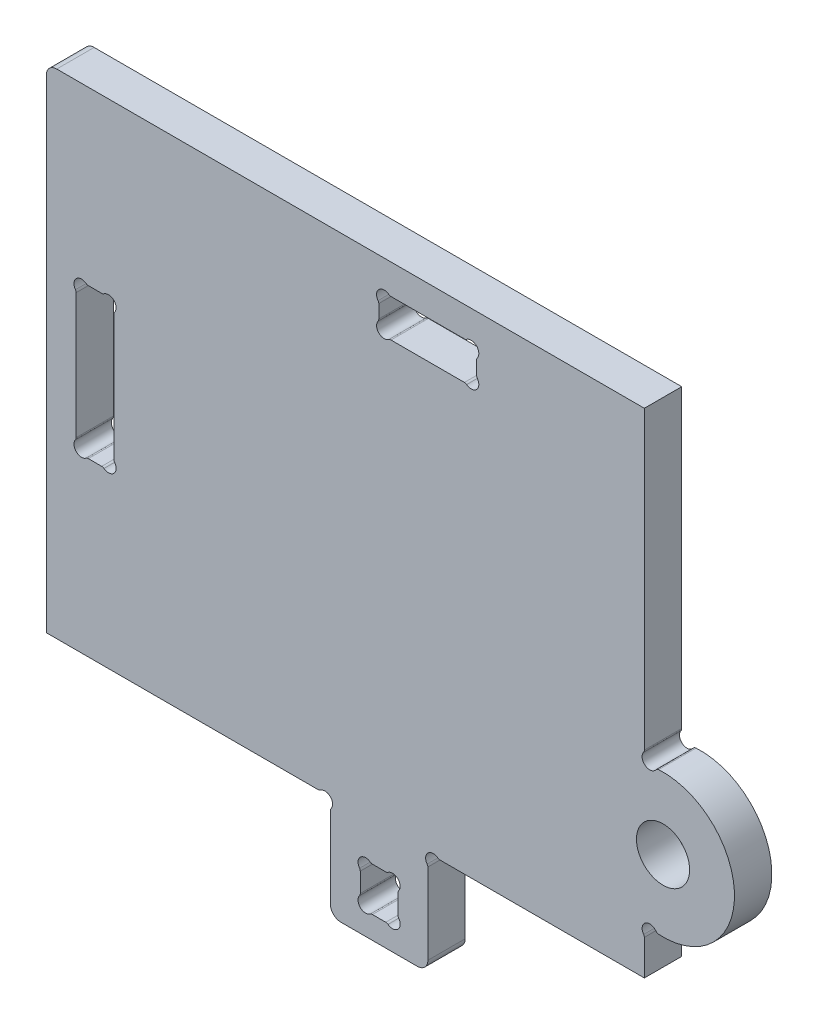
ISO-10303-21;
HEADER;
FILE_DESCRIPTION(('STEP AP214'),'2;1');
FILE_NAME('part.step','',(''),(''),'','','');
FILE_SCHEMA(('AUTOMOTIVE_DESIGN { 1 0 10303 214 1 1 1 1 }'));
ENDSEC;
DATA;
#1=APPLICATION_CONTEXT('core data for automotive mechanical design processes');
#2=APPLICATION_PROTOCOL_DEFINITION('international standard','automotive_design',2000,#1);
#3=PRODUCT_CONTEXT('',#1,'mechanical');
#4=PRODUCT('Part','Part','',(#3));
#5=PRODUCT_RELATED_PRODUCT_CATEGORY('part','',(#4));
#6=PRODUCT_DEFINITION_FORMATION('','',#4);
#7=PRODUCT_DEFINITION_CONTEXT('part definition',#1,'design');
#8=PRODUCT_DEFINITION('design','',#6,#7);
#9=PRODUCT_DEFINITION_SHAPE('','',#8);
#10=(LENGTH_UNIT() NAMED_UNIT(*) SI_UNIT(.MILLI.,.METRE.));
#11=(NAMED_UNIT(*) PLANE_ANGLE_UNIT() SI_UNIT($,.RADIAN.));
#12=(NAMED_UNIT(*) SI_UNIT($,.STERADIAN.) SOLID_ANGLE_UNIT());
#13=UNCERTAINTY_MEASURE_WITH_UNIT(LENGTH_MEASURE(1.E-05),#10,'distance_accuracy_value','');
#14=(GEOMETRIC_REPRESENTATION_CONTEXT(3) GLOBAL_UNCERTAINTY_ASSIGNED_CONTEXT((#13)) GLOBAL_UNIT_ASSIGNED_CONTEXT((#10,
#11,#12)) REPRESENTATION_CONTEXT('',''));
#15=CARTESIAN_POINT('',(0.,0.,0.));
#16=DIRECTION('',(0.,0.,1.));
#17=DIRECTION('',(1.,0.,0.));
#18=AXIS2_PLACEMENT_3D('',#15,#16,#17);
#19=CARTESIAN_POINT('',(2.5,61.0356262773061,25.));
#20=DIRECTION('',(0.,0.,-1.));
#21=DIRECTION('',(-1.,0.,0.));
#22=AXIS2_PLACEMENT_3D('',#19,#20,#21);
#23=PLANE('',#22);
#24=CARTESIAN_POINT('',(-166.393755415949,187.672911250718,25.));
#25=DIRECTION('',(0.,0.,1.));
#26=DIRECTION('',(1.,0.,0.));
#27=AXIS2_PLACEMENT_3D('',#24,#25,#26);
#28=CIRCLE('',#27,5.1);
#29=CARTESIAN_POINT('',(-170.491366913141,190.709287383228,25.));
#30=VERTEX_POINT('',#29);
#31=CARTESIAN_POINT('',(-163.357379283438,183.575299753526,25.));
#32=VERTEX_POINT('',#31);
#33=EDGE_CURVE('E550',#30,#32,#28,.T.);
#34=ORIENTED_EDGE('',*,*,#33,.F.);
#35=CARTESIAN_POINT('',(-172.5,192.197707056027,25.));
#36=DIRECTION('',(0.,0.,-1.));
#37=DIRECTION('',(1.,0.,0.));
#38=AXIS2_PLACEMENT_3D('',#35,#36,#37);
#39=CIRCLE('',#38,2.49999999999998);
#40=CARTESIAN_POINT('',(-170.,192.197707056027,25.));
#41=VERTEX_POINT('',#40);
#42=EDGE_CURVE('E48',#41,#30,#39,.T.);
#43=ORIENTED_EDGE('',*,*,#42,.F.);
#44=DIRECTION('',(0.,-1.,0.));
#45=VECTOR('',#44,1.);
#46=CARTESIAN_POINT('',(-170.,276.135626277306,25.));
#47=LINE('',#46,#45);
#48=CARTESIAN_POINT('',(-170.,276.135626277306,25.));
#49=VERTEX_POINT('',#48);
#50=EDGE_CURVE('E506',#49,#41,#47,.T.);
#51=ORIENTED_EDGE('',*,*,#50,.F.);
#52=CARTESIAN_POINT('',(-172.5,276.135626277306,25.));
#53=DIRECTION('',(0.,0.,-1.));
#54=DIRECTION('',(-1.,0.,0.));
#55=AXIS2_PLACEMENT_3D('',#52,#53,#54);
#56=CIRCLE('',#55,2.49999999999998);
#57=CARTESIAN_POINT('',(-170.491366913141,277.624045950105,25.));
#58=VERTEX_POINT('',#57);
#59=EDGE_CURVE('E509',#58,#49,#56,.T.);
#60=ORIENTED_EDGE('',*,*,#59,.F.);
#61=CARTESIAN_POINT('',(-166.393755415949,280.660422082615,25.));
#62=DIRECTION('',(0.,0.,1.));
#63=DIRECTION('',(-1.,0.,0.));
#64=AXIS2_PLACEMENT_3D('',#61,#62,#63);
#65=CIRCLE('',#64,5.1);
#66=CARTESIAN_POINT('',(-163.357379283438,284.758033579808,25.));
#67=VERTEX_POINT('',#66);
#68=EDGE_CURVE('E585',#67,#58,#65,.T.);
#69=ORIENTED_EDGE('',*,*,#68,.F.);
#70=CARTESIAN_POINT('',(-161.868959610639,286.766666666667,25.));
#71=DIRECTION('',(0.,0.,-1.));
#72=DIRECTION('',(1.,0.,0.));
#73=AXIS2_PLACEMENT_3D('',#70,#71,#72);
#74=CIRCLE('',#73,2.49999999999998);
#75=CARTESIAN_POINT('',(-161.868959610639,284.266666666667,25.));
#76=VERTEX_POINT('',#75);
#77=EDGE_CURVE('E582',#76,#67,#74,.T.);
#78=ORIENTED_EDGE('',*,*,#77,.F.);
#79=DIRECTION('',(-1.,0.,0.));
#80=VECTOR('',#79,1.);
#81=CARTESIAN_POINT('',(-161.868959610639,284.266666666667,25.));
#82=LINE('',#81,#80);
#83=CARTESIAN_POINT('',(-152.931040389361,284.266666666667,25.));
#84=VERTEX_POINT('',#83);
#85=EDGE_CURVE('E579',#84,#76,#82,.T.);
#86=ORIENTED_EDGE('',*,*,#85,.F.);
#87=CARTESIAN_POINT('',(-152.931040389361,286.766666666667,25.));
#88=DIRECTION('',(0.,0.,-1.));
#89=DIRECTION('',(-1.,0.,0.));
#90=AXIS2_PLACEMENT_3D('',#87,#88,#89);
#91=CIRCLE('',#90,2.49999999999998);
#92=CARTESIAN_POINT('',(-151.442620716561,284.758033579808,25.));
#93=VERTEX_POINT('',#92);
#94=EDGE_CURVE('E576',#93,#84,#91,.T.);
#95=ORIENTED_EDGE('',*,*,#94,.F.);
#96=CARTESIAN_POINT('',(-148.406244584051,280.660422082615,25.));
#97=DIRECTION('',(0.,0.,1.));
#98=DIRECTION('',(1.,0.,0.));
#99=AXIS2_PLACEMENT_3D('',#96,#97,#98);
#100=CIRCLE('',#99,5.1);
#101=CARTESIAN_POINT('',(-144.308633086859,277.624045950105,25.));
#102=VERTEX_POINT('',#101);
#103=EDGE_CURVE('E573',#102,#93,#100,.T.);
#104=ORIENTED_EDGE('',*,*,#103,.F.);
#105=CARTESIAN_POINT('',(-142.3,276.135626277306,25.));
#106=DIRECTION('',(0.,0.,-1.));
#107=DIRECTION('',(1.,0.,0.));
#108=AXIS2_PLACEMENT_3D('',#105,#106,#107);
#109=CIRCLE('',#108,2.49999999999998);
#110=CARTESIAN_POINT('',(-144.8,276.135626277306,25.));
#111=VERTEX_POINT('',#110);
#112=EDGE_CURVE('E570',#111,#102,#109,.T.);
#113=ORIENTED_EDGE('',*,*,#112,.F.);
#114=DIRECTION('',(0.,1.,0.));
#115=VECTOR('',#114,1.);
#116=CARTESIAN_POINT('',(-144.8,276.135626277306,25.));
#117=LINE('',#116,#115);
#118=CARTESIAN_POINT('',(-144.8,192.197707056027,25.));
#119=VERTEX_POINT('',#118);
#120=EDGE_CURVE('E567',#119,#111,#117,.T.);
#121=ORIENTED_EDGE('',*,*,#120,.F.);
#122=CARTESIAN_POINT('',(-142.3,192.197707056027,25.));
#123=DIRECTION('',(0.,0.,-1.));
#124=DIRECTION('',(-1.,0.,0.));
#125=AXIS2_PLACEMENT_3D('',#122,#123,#124);
#126=CIRCLE('',#125,2.49999999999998);
#127=CARTESIAN_POINT('',(-144.308633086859,190.709287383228,25.));
#128=VERTEX_POINT('',#127);
#129=EDGE_CURVE('E564',#128,#119,#126,.T.);
#130=ORIENTED_EDGE('',*,*,#129,.F.);
#131=CARTESIAN_POINT('',(-148.406244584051,187.672911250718,25.));
#132=DIRECTION('',(0.,0.,1.));
#133=DIRECTION('',(-1.,0.,0.));
#134=AXIS2_PLACEMENT_3D('',#131,#132,#133);
#135=CIRCLE('',#134,5.1);
#136=CARTESIAN_POINT('',(-151.442620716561,183.575299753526,25.));
#137=VERTEX_POINT('',#136);
#138=EDGE_CURVE('E561',#137,#128,#135,.T.);
#139=ORIENTED_EDGE('',*,*,#138,.F.);
#140=CARTESIAN_POINT('',(-152.93104038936,181.566666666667,25.));
#141=DIRECTION('',(0.,0.,-1.));
#142=DIRECTION('',(1.,0.,0.));
#143=AXIS2_PLACEMENT_3D('',#140,#141,#142);
#144=CIRCLE('',#143,2.49999999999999);
#145=CARTESIAN_POINT('',(-152.93104038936,184.066666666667,25.));
#146=VERTEX_POINT('',#145);
#147=EDGE_CURVE('E558',#146,#137,#144,.T.);
#148=ORIENTED_EDGE('',*,*,#147,.F.);
#149=DIRECTION('',(1.,0.,0.));
#150=VECTOR('',#149,1.);
#151=CARTESIAN_POINT('',(-161.868959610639,184.066666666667,25.));
#152=LINE('',#151,#150);
#153=CARTESIAN_POINT('',(-161.868959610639,184.066666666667,25.));
#154=VERTEX_POINT('',#153);
#155=EDGE_CURVE('E555',#154,#146,#152,.T.);
#156=ORIENTED_EDGE('',*,*,#155,.F.);
#157=CARTESIAN_POINT('',(-161.868959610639,181.566666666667,25.));
#158=DIRECTION('',(0.,0.,-1.));
#159=DIRECTION('',(-1.,0.,0.));
#160=AXIS2_PLACEMENT_3D('',#157,#158,#159);
#161=CIRCLE('',#160,2.49999999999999);
#162=EDGE_CURVE('E552',#32,#154,#161,.T.);
#163=ORIENTED_EDGE('',*,*,#162,.F.);
#164=EDGE_LOOP('',(#34,#43,#51,#60,#69,#78,#86,#95,#104,#113,#121,#130,#139,#148,#156,#163));
#165=FACE_BOUND('',#164,.T.);
#166=CARTESIAN_POINT('',(36.0062445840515,375.560422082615,25.));
#167=DIRECTION('',(0.,0.,1.));
#168=DIRECTION('',(1.,0.,0.));
#169=AXIS2_PLACEMENT_3D('',#166,#167,#168);
#170=CIRCLE('',#169,5.10000000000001);
#171=CARTESIAN_POINT('',(39.0426207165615,379.658033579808,25.));
#172=VERTEX_POINT('',#171);
#173=CARTESIAN_POINT('',(31.9086330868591,372.524045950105,25.));
#174=VERTEX_POINT('',#173);
#175=EDGE_CURVE('E671',#172,#174,#170,.T.);
#176=ORIENTED_EDGE('',*,*,#175,.F.);
#177=CARTESIAN_POINT('',(40.5310403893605,381.666666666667,25.));
#178=DIRECTION('',(0.,0.,-1.));
#179=DIRECTION('',(1.,0.,0.));
#180=AXIS2_PLACEMENT_3D('',#177,#178,#179);
#181=CIRCLE('',#180,2.49999999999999);
#182=CARTESIAN_POINT('',(40.5310403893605,379.166666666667,25.));
#183=VERTEX_POINT('',#182);
#184=EDGE_CURVE('E592',#183,#172,#181,.T.);
#185=ORIENTED_EDGE('',*,*,#184,.F.);
#186=DIRECTION('',(-1.,0.,0.));
#187=VECTOR('',#186,1.);
#188=CARTESIAN_POINT('',(89.6689596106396,379.166666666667,25.));
#189=LINE('',#188,#187);
#190=CARTESIAN_POINT('',(89.6689596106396,379.166666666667,25.));
#191=VERTEX_POINT('',#190);
#192=EDGE_CURVE('E624',#191,#183,#189,.T.);
#193=ORIENTED_EDGE('',*,*,#192,.F.);
#194=CARTESIAN_POINT('',(89.6689596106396,381.666666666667,25.));
#195=DIRECTION('',(0.,0.,-1.));
#196=DIRECTION('',(-1.,0.,0.));
#197=AXIS2_PLACEMENT_3D('',#194,#195,#196);
#198=CIRCLE('',#197,2.49999999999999);
#199=CARTESIAN_POINT('',(91.1573792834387,379.658033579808,25.));
#200=VERTEX_POINT('',#199);
#201=EDGE_CURVE('E710',#200,#191,#198,.T.);
#202=ORIENTED_EDGE('',*,*,#201,.F.);
#203=CARTESIAN_POINT('',(94.1937554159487,375.560422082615,25.));
#204=DIRECTION('',(0.,0.,1.));
#205=DIRECTION('',(-1.,0.,0.));
#206=AXIS2_PLACEMENT_3D('',#203,#204,#205);
#207=CIRCLE('',#206,5.10000000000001);
#208=CARTESIAN_POINT('',(98.291366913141,372.524045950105,25.));
#209=VERTEX_POINT('',#208);
#210=EDGE_CURVE('E707',#209,#200,#207,.T.);
#211=ORIENTED_EDGE('',*,*,#210,.F.);
#212=CARTESIAN_POINT('',(100.3,371.035626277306,25.));
#213=DIRECTION('',(0.,0.,-1.));
#214=DIRECTION('',(1.,0.,0.));
#215=AXIS2_PLACEMENT_3D('',#212,#213,#214);
#216=CIRCLE('',#215,2.50000000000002);
#217=CARTESIAN_POINT('',(97.8000000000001,371.035626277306,25.));
#218=VERTEX_POINT('',#217);
#219=EDGE_CURVE('E704',#218,#209,#216,.T.);
#220=ORIENTED_EDGE('',*,*,#219,.F.);
#221=DIRECTION('',(0.,1.,0.));
#222=VECTOR('',#221,1.);
#223=CARTESIAN_POINT('',(97.8000000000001,371.035626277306,25.));
#224=LINE('',#223,#222);
#225=CARTESIAN_POINT('',(97.8000000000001,362.097707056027,25.));
#226=VERTEX_POINT('',#225);
#227=EDGE_CURVE('E701',#226,#218,#224,.T.);
#228=ORIENTED_EDGE('',*,*,#227,.F.);
#229=CARTESIAN_POINT('',(100.3,362.097707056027,25.));
#230=DIRECTION('',(0.,0.,-1.));
#231=DIRECTION('',(-1.,0.,0.));
#232=AXIS2_PLACEMENT_3D('',#229,#230,#231);
#233=CIRCLE('',#232,2.50000000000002);
#234=CARTESIAN_POINT('',(98.2913669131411,360.609287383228,25.));
#235=VERTEX_POINT('',#234);
#236=EDGE_CURVE('E698',#235,#226,#233,.T.);
#237=ORIENTED_EDGE('',*,*,#236,.F.);
#238=CARTESIAN_POINT('',(94.1937554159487,357.572911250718,25.));
#239=DIRECTION('',(0.,0.,1.));
#240=DIRECTION('',(1.,0.,0.));
#241=AXIS2_PLACEMENT_3D('',#238,#239,#240);
#242=CIRCLE('',#241,5.10000000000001);
#243=CARTESIAN_POINT('',(91.1573792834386,353.475299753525,25.));
#244=VERTEX_POINT('',#243);
#245=EDGE_CURVE('E695',#244,#235,#242,.T.);
#246=ORIENTED_EDGE('',*,*,#245,.F.);
#247=CARTESIAN_POINT('',(89.6689596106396,351.466666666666,25.));
#248=DIRECTION('',(0.,0.,-1.));
#249=DIRECTION('',(1.,0.,0.));
#250=AXIS2_PLACEMENT_3D('',#247,#248,#249);
#251=CIRCLE('',#250,2.49999999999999);
#252=CARTESIAN_POINT('',(89.6689596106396,353.966666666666,25.));
#253=VERTEX_POINT('',#252);
#254=EDGE_CURVE('E692',#253,#244,#251,.T.);
#255=ORIENTED_EDGE('',*,*,#254,.F.);
#256=DIRECTION('',(1.,0.,0.));
#257=VECTOR('',#256,1.);
#258=CARTESIAN_POINT('',(89.6689596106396,353.966666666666,25.));
#259=LINE('',#258,#257);
#260=CARTESIAN_POINT('',(40.5310403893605,353.966666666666,25.));
#261=VERTEX_POINT('',#260);
#262=EDGE_CURVE('E689',#261,#253,#259,.T.);
#263=ORIENTED_EDGE('',*,*,#262,.F.);
#264=CARTESIAN_POINT('',(40.5310403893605,351.466666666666,25.));
#265=DIRECTION('',(0.,0.,-1.));
#266=DIRECTION('',(-1.,0.,0.));
#267=AXIS2_PLACEMENT_3D('',#264,#265,#266);
#268=CIRCLE('',#267,2.49999999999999);
#269=CARTESIAN_POINT('',(39.0426207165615,353.475299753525,25.));
#270=VERTEX_POINT('',#269);
#271=EDGE_CURVE('E686',#270,#261,#268,.T.);
#272=ORIENTED_EDGE('',*,*,#271,.F.);
#273=CARTESIAN_POINT('',(36.0062445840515,357.572911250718,25.));
#274=DIRECTION('',(0.,0.,1.));
#275=DIRECTION('',(-1.,0.,0.));
#276=AXIS2_PLACEMENT_3D('',#273,#274,#275);
#277=CIRCLE('',#276,5.10000000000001);
#278=CARTESIAN_POINT('',(31.9086330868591,360.609287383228,25.));
#279=VERTEX_POINT('',#278);
#280=EDGE_CURVE('E683',#279,#270,#277,.T.);
#281=ORIENTED_EDGE('',*,*,#280,.F.);
#282=CARTESIAN_POINT('',(29.9000000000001,362.097707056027,25.));
#283=DIRECTION('',(0.,0.,-1.));
#284=DIRECTION('',(1.,0.,0.));
#285=AXIS2_PLACEMENT_3D('',#282,#283,#284);
#286=CIRCLE('',#285,2.50000000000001);
#287=CARTESIAN_POINT('',(32.4000000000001,362.097707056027,25.));
#288=VERTEX_POINT('',#287);
#289=EDGE_CURVE('E680',#288,#279,#286,.T.);
#290=ORIENTED_EDGE('',*,*,#289,.F.);
#291=DIRECTION('',(0.,-1.,0.));
#292=VECTOR('',#291,1.);
#293=CARTESIAN_POINT('',(32.4000000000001,371.035626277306,25.));
#294=LINE('',#293,#292);
#295=CARTESIAN_POINT('',(32.4000000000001,371.035626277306,25.));
#296=VERTEX_POINT('',#295);
#297=EDGE_CURVE('E677',#296,#288,#294,.T.);
#298=ORIENTED_EDGE('',*,*,#297,.F.);
#299=CARTESIAN_POINT('',(29.9000000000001,371.035626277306,25.));
#300=DIRECTION('',(0.,0.,-1.));
#301=DIRECTION('',(-1.,0.,0.));
#302=AXIS2_PLACEMENT_3D('',#299,#300,#301);
#303=CIRCLE('',#302,2.50000000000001);
#304=EDGE_CURVE('E674',#174,#296,#303,.T.);
#305=ORIENTED_EDGE('',*,*,#304,.F.);
#306=EDGE_LOOP('',(#176,#185,#193,#202,#211,#220,#228,#237,#246,#255,#263,#272,#281,#290,#298,#305));
#307=FACE_BOUND('',#306,.T.);
#308=DIRECTION('',(-1.,0.,0.));
#309=VECTOR('',#308,1.);
#310=CARTESIAN_POINT('',(-190.,399.166666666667,25.));
#311=LINE('',#310,#309);
#312=CARTESIAN_POINT('',(210.,399.166666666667,25.));
#313=VERTEX_POINT('',#312);
#314=CARTESIAN_POINT('',(-183.,399.166666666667,25.));
#315=VERTEX_POINT('',#314);
#316=EDGE_CURVE('E904',#313,#315,#311,.T.);
#317=ORIENTED_EDGE('',*,*,#316,.T.);
#318=CARTESIAN_POINT('',(-183.,392.166666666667,25.));
#319=DIRECTION('',(0.,0.,-1.));
#320=DIRECTION('',(-1.,0.,0.));
#321=AXIS2_PLACEMENT_3D('',#318,#319,#320);
#322=CIRCLE('',#321,7.);
#323=CARTESIAN_POINT('',(-190.,392.166666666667,25.));
#324=VERTEX_POINT('',#323);
#325=EDGE_CURVE('E1034',#315,#324,#322,.F.);
#326=ORIENTED_EDGE('',*,*,#325,.T.);
#327=DIRECTION('',(0.,-1.,0.));
#328=VECTOR('',#327,1.);
#329=CARTESIAN_POINT('',(-190.,69.1666666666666,25.));
#330=LINE('',#329,#328);
#331=CARTESIAN_POINT('',(-190.,69.1666666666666,25.));
#332=VERTEX_POINT('',#331);
#333=EDGE_CURVE('E907',#324,#332,#330,.T.);
#334=ORIENTED_EDGE('',*,*,#333,.T.);
#335=DIRECTION('',(1.,0.,0.));
#336=VECTOR('',#335,1.);
#337=CARTESIAN_POINT('',(-8.1310403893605,69.1666666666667,25.));
#338=LINE('',#337,#336);
#339=CARTESIAN_POINT('',(-8.1310403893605,69.1666666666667,25.));
#340=VERTEX_POINT('',#339);
#341=EDGE_CURVE('E909',#332,#340,#338,.T.);
#342=ORIENTED_EDGE('',*,*,#341,.T.);
#343=CARTESIAN_POINT('',(-8.1310403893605,71.6666666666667,25.));
#344=DIRECTION('',(0.,0.,1.));
#345=DIRECTION('',(-1.,0.,0.));
#346=AXIS2_PLACEMENT_3D('',#343,#344,#345);
#347=CIRCLE('',#346,2.5);
#348=CARTESIAN_POINT('',(-6.64262071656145,69.6580335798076,25.));
#349=VERTEX_POINT('',#348);
#350=EDGE_CURVE('E911',#340,#349,#347,.T.);
#351=ORIENTED_EDGE('',*,*,#350,.T.);
#352=CARTESIAN_POINT('',(-3.60624458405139,65.5604220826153,25.));
#353=DIRECTION('',(0.,0.,-1.));
#354=DIRECTION('',(1.,0.,0.));
#355=AXIS2_PLACEMENT_3D('',#352,#353,#354);
#356=CIRCLE('',#355,5.1);
#357=CARTESIAN_POINT('',(0.491366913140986,62.5240459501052,25.));
#358=VERTEX_POINT('',#357);
#359=EDGE_CURVE('E913',#349,#358,#356,.T.);
#360=ORIENTED_EDGE('',*,*,#359,.T.);
#361=CARTESIAN_POINT('',(2.5,61.0356262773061,25.));
#362=DIRECTION('',(0.,0.,1.));
#363=DIRECTION('',(-1.,0.,0.));
#364=AXIS2_PLACEMENT_3D('',#361,#362,#363);
#365=CIRCLE('',#364,2.5);
#366=CARTESIAN_POINT('',(0.,61.0356262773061,25.));
#367=VERTEX_POINT('',#366);
#368=EDGE_CURVE('E915',#358,#367,#365,.T.);
#369=ORIENTED_EDGE('',*,*,#368,.T.);
#370=DIRECTION('',(0.,-1.,0.));
#371=VECTOR('',#370,1.);
#372=CARTESIAN_POINT('',(0.,0.,25.));
#373=LINE('',#372,#371);
#374=CARTESIAN_POINT('',(0.,7.,25.));
#375=VERTEX_POINT('',#374);
#376=EDGE_CURVE('E869',#367,#375,#373,.T.);
#377=ORIENTED_EDGE('',*,*,#376,.T.);
#378=CARTESIAN_POINT('',(7.,7.,25.));
#379=DIRECTION('',(0.,0.,-1.));
#380=DIRECTION('',(-1.,0.,0.));
#381=AXIS2_PLACEMENT_3D('',#378,#379,#380);
#382=CIRCLE('',#381,7.);
#383=CARTESIAN_POINT('',(7.,0.,25.));
#384=VERTEX_POINT('',#383);
#385=EDGE_CURVE('E1030',#375,#384,#382,.F.);
#386=ORIENTED_EDGE('',*,*,#385,.T.);
#387=DIRECTION('',(1.,0.,0.));
#388=VECTOR('',#387,1.);
#389=CARTESIAN_POINT('',(0.,0.,25.));
#390=LINE('',#389,#388);
#391=CARTESIAN_POINT('',(58.2,0.,25.));
#392=VERTEX_POINT('',#391);
#393=EDGE_CURVE('E872',#384,#392,#390,.T.);
#394=ORIENTED_EDGE('',*,*,#393,.T.);
#395=CARTESIAN_POINT('',(58.2,7.,25.));
#396=DIRECTION('',(0.,0.,-1.));
#397=DIRECTION('',(-1.,0.,0.));
#398=AXIS2_PLACEMENT_3D('',#395,#396,#397);
#399=CIRCLE('',#398,7.);
#400=CARTESIAN_POINT('',(65.2,7.,25.));
#401=VERTEX_POINT('',#400);
#402=EDGE_CURVE('E1032',#392,#401,#399,.F.);
#403=ORIENTED_EDGE('',*,*,#402,.T.);
#404=DIRECTION('',(0.,1.,0.));
#405=VECTOR('',#404,1.);
#406=CARTESIAN_POINT('',(65.2,0.,25.));
#407=LINE('',#406,#405);
#408=CARTESIAN_POINT('',(65.2,61.035626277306,25.));
#409=VERTEX_POINT('',#408);
#410=EDGE_CURVE('E876',#401,#409,#407,.T.);
#411=ORIENTED_EDGE('',*,*,#410,.T.);
#412=CARTESIAN_POINT('',(62.7,61.035626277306,25.));
#413=DIRECTION('',(0.,0.,1.));
#414=DIRECTION('',(-1.,0.,0.));
#415=AXIS2_PLACEMENT_3D('',#412,#413,#414);
#416=CIRCLE('',#415,2.49999999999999);
#417=CARTESIAN_POINT('',(64.708633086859,62.5240459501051,25.));
#418=VERTEX_POINT('',#417);
#419=EDGE_CURVE('E878',#409,#418,#416,.T.);
#420=ORIENTED_EDGE('',*,*,#419,.T.);
#421=CARTESIAN_POINT('',(68.8062445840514,65.5604220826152,25.));
#422=DIRECTION('',(0.,0.,-1.));
#423=DIRECTION('',(1.,0.,0.));
#424=AXIS2_PLACEMENT_3D('',#421,#422,#423);
#425=CIRCLE('',#424,5.10000000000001);
#426=CARTESIAN_POINT('',(71.8426207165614,69.6580335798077,25.));
#427=VERTEX_POINT('',#426);
#428=EDGE_CURVE('E880',#418,#427,#425,.T.);
#429=ORIENTED_EDGE('',*,*,#428,.T.);
#430=CARTESIAN_POINT('',(73.3310403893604,71.6666666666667,25.));
#431=DIRECTION('',(0.,0.,1.));
#432=DIRECTION('',(1.,0.,0.));
#433=AXIS2_PLACEMENT_3D('',#430,#431,#432);
#434=CIRCLE('',#433,2.49999999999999);
#435=CARTESIAN_POINT('',(73.3310403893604,69.1666666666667,25.));
#436=VERTEX_POINT('',#435);
#437=EDGE_CURVE('E882',#427,#436,#434,.T.);
#438=ORIENTED_EDGE('',*,*,#437,.T.);
#439=DIRECTION('',(1.,0.,0.));
#440=VECTOR('',#439,1.);
#441=CARTESIAN_POINT('',(73.3310403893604,69.1666666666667,25.));
#442=LINE('',#441,#440);
#443=CARTESIAN_POINT('',(210.,69.1666666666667,25.));
#444=VERTEX_POINT('',#443);
#445=EDGE_CURVE('E884',#436,#444,#442,.T.);
#446=ORIENTED_EDGE('',*,*,#445,.T.);
#447=DIRECTION('',(0.,1.,0.));
#448=VECTOR('',#447,1.);
#449=CARTESIAN_POINT('',(210.,92.6997868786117,25.));
#450=LINE('',#449,#448);
#451=CARTESIAN_POINT('',(210.,92.6997868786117,25.));
#452=VERTEX_POINT('',#451);
#453=EDGE_CURVE('E886',#444,#452,#450,.T.);
#454=ORIENTED_EDGE('',*,*,#453,.T.);
#455=CARTESIAN_POINT('',(207.5,92.6997868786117,25.));
#456=DIRECTION('',(0.,0.,1.));
#457=DIRECTION('',(-1.,0.,0.));
#458=AXIS2_PLACEMENT_3D('',#455,#456,#457);
#459=CIRCLE('',#458,2.5);
#460=CARTESIAN_POINT('',(209.508633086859,94.1882065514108,25.));
#461=VERTEX_POINT('',#460);
#462=EDGE_CURVE('E888',#452,#461,#459,.T.);
#463=ORIENTED_EDGE('',*,*,#462,.T.);
#464=CARTESIAN_POINT('',(213.606244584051,97.2245826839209,25.));
#465=DIRECTION('',(0.,0.,-1.));
#466=DIRECTION('',(-1.,0.,0.));
#467=AXIS2_PLACEMENT_3D('',#464,#465,#466);
#468=CIRCLE('',#467,5.09999999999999);
#469=CARTESIAN_POINT('',(217.702200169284,100.263192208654,25.));
#470=VERTEX_POINT('',#469);
#471=EDGE_CURVE('E890',#461,#470,#468,.T.);
#472=ORIENTED_EDGE('',*,*,#471,.T.);
#473=CARTESIAN_POINT('',(219.710021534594,101.752706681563,25.));
#474=DIRECTION('',(0.,0.,1.));
#475=DIRECTION('',(1.,0.,0.));
#476=AXIS2_PLACEMENT_3D('',#473,#474,#475);
#477=CIRCLE('',#476,2.50000000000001);
#478=CARTESIAN_POINT('',(219.555973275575,99.2574573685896,25.));
#479=VERTEX_POINT('',#478);
#480=EDGE_CURVE('E892',#470,#479,#477,.T.);
#481=ORIENTED_EDGE('',*,*,#480,.T.);
#482=CARTESIAN_POINT('',(222.5,146.94433619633,25.));
#483=DIRECTION('',(0.,0.,1.));
#484=DIRECTION('',(1.,0.,0.));
#485=AXIS2_PLACEMENT_3D('',#482,#483,#484);
#486=CIRCLE('',#485,47.7776695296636);
#487=CARTESIAN_POINT('',(219.555973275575,194.631215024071,25.));
#488=VERTEX_POINT('',#487);
#489=EDGE_CURVE('E894',#479,#488,#486,.T.);
#490=ORIENTED_EDGE('',*,*,#489,.T.);
#491=CARTESIAN_POINT('',(219.710021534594,192.135965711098,25.));
#492=DIRECTION('',(0.,0.,1.));
#493=DIRECTION('',(-1.,0.,0.));
#494=AXIS2_PLACEMENT_3D('',#491,#492,#493);
#495=CIRCLE('',#494,2.50000000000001);
#496=CARTESIAN_POINT('',(217.702200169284,193.625480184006,25.));
#497=VERTEX_POINT('',#496);
#498=EDGE_CURVE('E896',#488,#497,#495,.T.);
#499=ORIENTED_EDGE('',*,*,#498,.T.);
#500=CARTESIAN_POINT('',(213.606244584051,196.66408970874,25.));
#501=DIRECTION('',(0.,0.,-1.));
#502=DIRECTION('',(1.,0.,0.));
#503=AXIS2_PLACEMENT_3D('',#500,#501,#502);
#504=CIRCLE('',#503,5.09999999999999);
#505=CARTESIAN_POINT('',(209.508633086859,199.70046584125,25.));
#506=VERTEX_POINT('',#505);
#507=EDGE_CURVE('E898',#497,#506,#504,.T.);
#508=ORIENTED_EDGE('',*,*,#507,.T.);
#509=CARTESIAN_POINT('',(207.5,201.188885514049,25.));
#510=DIRECTION('',(0.,0.,1.));
#511=DIRECTION('',(1.,0.,0.));
#512=AXIS2_PLACEMENT_3D('',#509,#510,#511);
#513=CIRCLE('',#512,2.5);
#514=CARTESIAN_POINT('',(210.,201.188885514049,25.));
#515=VERTEX_POINT('',#514);
#516=EDGE_CURVE('E900',#506,#515,#513,.T.);
#517=ORIENTED_EDGE('',*,*,#516,.T.);
#518=DIRECTION('',(0.,1.,0.));
#519=VECTOR('',#518,1.);
#520=CARTESIAN_POINT('',(210.,399.166666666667,25.));
#521=LINE('',#520,#519);
#522=EDGE_CURVE('E902',#515,#313,#521,.T.);
#523=ORIENTED_EDGE('',*,*,#522,.T.);
#524=EDGE_LOOP('',(#317,#326,#334,#342,#351,#360,#369,#377,#386,#394,#403,#411,#420,#429,#438,
#446,#454,#463,#472,#481,#490,#499,#508,#517,#523));
#525=FACE_BOUND('',#524,.T.);
#526=CARTESIAN_POINT('',(47.7,36.0356262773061,25.));
#527=DIRECTION('',(0.,0.,-1.));
#528=DIRECTION('',(1.,0.,0.));
#529=AXIS2_PLACEMENT_3D('',#526,#527,#528);
#530=CIRCLE('',#529,2.50000000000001);
#531=CARTESIAN_POINT('',(45.2,36.0356262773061,25.));
#532=VERTEX_POINT('',#531);
#533=CARTESIAN_POINT('',(45.691366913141,37.5240459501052,25.));
#534=VERTEX_POINT('',#533);
#535=EDGE_CURVE('E754',#532,#534,#530,.T.);
#536=ORIENTED_EDGE('',*,*,#535,.F.);
#537=DIRECTION('',(0.,1.,0.));
#538=VECTOR('',#537,1.);
#539=CARTESIAN_POINT('',(45.2,23.1310403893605,25.));
#540=LINE('',#539,#538);
#541=CARTESIAN_POINT('',(45.2,23.1310403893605,25.));
#542=VERTEX_POINT('',#541);
#543=EDGE_CURVE('E786',#542,#532,#540,.T.);
#544=ORIENTED_EDGE('',*,*,#543,.F.);
#545=CARTESIAN_POINT('',(47.7,23.1310403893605,25.));
#546=DIRECTION('',(0.,0.,-1.));
#547=DIRECTION('',(-1.,0.,0.));
#548=AXIS2_PLACEMENT_3D('',#545,#546,#547);
#549=CIRCLE('',#548,2.50000000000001);
#550=CARTESIAN_POINT('',(45.691366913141,21.6426207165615,25.));
#551=VERTEX_POINT('',#550);
#552=EDGE_CURVE('E783',#551,#542,#549,.T.);
#553=ORIENTED_EDGE('',*,*,#552,.F.);
#554=CARTESIAN_POINT('',(41.5937554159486,18.6062445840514,25.));
#555=DIRECTION('',(0.,0.,1.));
#556=DIRECTION('',(-1.,0.,0.));
#557=AXIS2_PLACEMENT_3D('',#554,#555,#556);
#558=CIRCLE('',#557,5.1);
#559=CARTESIAN_POINT('',(38.5573792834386,14.508633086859,25.));
#560=VERTEX_POINT('',#559);
#561=EDGE_CURVE('E781',#560,#551,#558,.T.);
#562=ORIENTED_EDGE('',*,*,#561,.F.);
#563=CARTESIAN_POINT('',(37.0689596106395,12.5,25.));
#564=DIRECTION('',(0.,0.,-1.));
#565=DIRECTION('',(1.,0.,0.));
#566=AXIS2_PLACEMENT_3D('',#563,#564,#565);
#567=CIRCLE('',#566,2.5);
#568=CARTESIAN_POINT('',(37.0689596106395,15.,25.));
#569=VERTEX_POINT('',#568);
#570=EDGE_CURVE('E779',#569,#560,#567,.T.);
#571=ORIENTED_EDGE('',*,*,#570,.F.);
#572=DIRECTION('',(1.,0.,0.));
#573=VECTOR('',#572,1.);
#574=CARTESIAN_POINT('',(37.0689596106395,15.,25.));
#575=LINE('',#574,#573);
#576=CARTESIAN_POINT('',(28.1310403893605,15.,25.));
#577=VERTEX_POINT('',#576);
#578=EDGE_CURVE('E777',#577,#569,#575,.T.);
#579=ORIENTED_EDGE('',*,*,#578,.F.);
#580=CARTESIAN_POINT('',(28.1310403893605,12.5,25.));
#581=DIRECTION('',(0.,0.,-1.));
#582=DIRECTION('',(-1.,0.,0.));
#583=AXIS2_PLACEMENT_3D('',#580,#581,#582);
#584=CIRCLE('',#583,2.5);
#585=CARTESIAN_POINT('',(26.6426207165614,14.508633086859,25.));
#586=VERTEX_POINT('',#585);
#587=EDGE_CURVE('E775',#586,#577,#584,.T.);
#588=ORIENTED_EDGE('',*,*,#587,.F.);
#589=CARTESIAN_POINT('',(23.6062445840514,18.6062445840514,25.));
#590=DIRECTION('',(0.,0.,1.));
#591=DIRECTION('',(1.,0.,0.));
#592=AXIS2_PLACEMENT_3D('',#589,#590,#591);
#593=CIRCLE('',#592,5.1);
#594=CARTESIAN_POINT('',(19.508633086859,21.6426207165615,25.));
#595=VERTEX_POINT('',#594);
#596=EDGE_CURVE('E773',#595,#586,#593,.T.);
#597=ORIENTED_EDGE('',*,*,#596,.F.);
#598=CARTESIAN_POINT('',(17.5,23.1310403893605,25.));
#599=DIRECTION('',(0.,0.,-1.));
#600=DIRECTION('',(1.,0.,0.));
#601=AXIS2_PLACEMENT_3D('',#598,#599,#600);
#602=CIRCLE('',#601,2.50000000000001);
#603=CARTESIAN_POINT('',(20.,23.1310403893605,25.));
#604=VERTEX_POINT('',#603);
#605=EDGE_CURVE('E771',#604,#595,#602,.T.);
#606=ORIENTED_EDGE('',*,*,#605,.F.);
#607=DIRECTION('',(0.,-1.,0.));
#608=VECTOR('',#607,1.);
#609=CARTESIAN_POINT('',(20.,23.1310403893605,25.));
#610=LINE('',#609,#608);
#611=CARTESIAN_POINT('',(20.,36.0356262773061,25.));
#612=VERTEX_POINT('',#611);
#613=EDGE_CURVE('E769',#612,#604,#610,.T.);
#614=ORIENTED_EDGE('',*,*,#613,.F.);
#615=CARTESIAN_POINT('',(17.5,36.0356262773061,25.));
#616=DIRECTION('',(0.,0.,-1.));
#617=DIRECTION('',(-1.,0.,0.));
#618=AXIS2_PLACEMENT_3D('',#615,#616,#617);
#619=CIRCLE('',#618,2.50000000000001);
#620=CARTESIAN_POINT('',(19.508633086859,37.5240459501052,25.));
#621=VERTEX_POINT('',#620);
#622=EDGE_CURVE('E767',#621,#612,#619,.T.);
#623=ORIENTED_EDGE('',*,*,#622,.F.);
#624=CARTESIAN_POINT('',(23.6062445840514,40.5604220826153,25.));
#625=DIRECTION('',(0.,0.,1.));
#626=DIRECTION('',(-1.,0.,0.));
#627=AXIS2_PLACEMENT_3D('',#624,#625,#626);
#628=CIRCLE('',#627,5.1);
#629=CARTESIAN_POINT('',(26.6426207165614,44.6580335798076,25.));
#630=VERTEX_POINT('',#629);
#631=EDGE_CURVE('E765',#630,#621,#628,.T.);
#632=ORIENTED_EDGE('',*,*,#631,.F.);
#633=CARTESIAN_POINT('',(28.1310403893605,46.6666666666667,25.));
#634=DIRECTION('',(0.,0.,-1.));
#635=DIRECTION('',(1.,0.,0.));
#636=AXIS2_PLACEMENT_3D('',#633,#634,#635);
#637=CIRCLE('',#636,2.5);
#638=CARTESIAN_POINT('',(28.1310403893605,44.1666666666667,25.));
#639=VERTEX_POINT('',#638);
#640=EDGE_CURVE('E763',#639,#630,#637,.T.);
#641=ORIENTED_EDGE('',*,*,#640,.F.);
#642=DIRECTION('',(-1.,0.,0.));
#643=VECTOR('',#642,1.);
#644=CARTESIAN_POINT('',(37.0689596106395,44.1666666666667,25.));
#645=LINE('',#644,#643);
#646=CARTESIAN_POINT('',(37.0689596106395,44.1666666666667,25.));
#647=VERTEX_POINT('',#646);
#648=EDGE_CURVE('E761',#647,#639,#645,.T.);
#649=ORIENTED_EDGE('',*,*,#648,.F.);
#650=CARTESIAN_POINT('',(37.0689596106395,46.6666666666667,25.));
#651=DIRECTION('',(0.,0.,-1.));
#652=DIRECTION('',(-1.,0.,0.));
#653=AXIS2_PLACEMENT_3D('',#650,#651,#652);
#654=CIRCLE('',#653,2.5);
#655=CARTESIAN_POINT('',(38.5573792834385,44.6580335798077,25.));
#656=VERTEX_POINT('',#655);
#657=EDGE_CURVE('E759',#656,#647,#654,.T.);
#658=ORIENTED_EDGE('',*,*,#657,.F.);
#659=CARTESIAN_POINT('',(41.5937554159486,40.5604220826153,25.));
#660=DIRECTION('',(0.,0.,1.));
#661=DIRECTION('',(1.,0.,0.));
#662=AXIS2_PLACEMENT_3D('',#659,#660,#661);
#663=CIRCLE('',#662,5.1);
#664=EDGE_CURVE('E756',#534,#656,#663,.T.);
#665=ORIENTED_EDGE('',*,*,#664,.F.);
#666=EDGE_LOOP('',(#536,#544,#553,#562,#571,#579,#588,#597,#606,#614,#623,#632,#641,#649,#658,#665));
#667=FACE_BOUND('',#666,.T.);
#668=CARTESIAN_POINT('',(222.5,146.94433619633,25.));
#669=DIRECTION('',(0.,0.,1.));
#670=DIRECTION('',(1.,0.,0.));
#671=AXIS2_PLACEMENT_3D('',#668,#669,#670);
#672=CIRCLE('',#671,17.7776695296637);
#673=CARTESIAN_POINT('',(240.277669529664,146.94433619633,25.));
#674=VERTEX_POINT('',#673);
#675=EDGE_CURVE('E748',#674,#674,#672,.T.);
#676=ORIENTED_EDGE('',*,*,#675,.F.);
#677=EDGE_LOOP('',(#676));
#678=FACE_BOUND('',#677,.T.);
#679=ADVANCED_FACE('F33',(#165,#307,#525,#667,#678),#23,.F.);
#680=CARTESIAN_POINT('',(2.5,61.0356262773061,0.));
#681=DIRECTION('',(0.,0.,-1.));
#682=DIRECTION('',(-1.,0.,0.));
#683=AXIS2_PLACEMENT_3D('',#680,#681,#682);
#684=PLANE('',#683);
#685=CARTESIAN_POINT('',(-172.5,192.197707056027,0.));
#686=DIRECTION('',(0.,0.,-1.));
#687=DIRECTION('',(1.,0.,0.));
#688=AXIS2_PLACEMENT_3D('',#685,#686,#687);
#689=CIRCLE('',#688,2.49999999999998);
#690=CARTESIAN_POINT('',(-170.,192.197707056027,0.));
#691=VERTEX_POINT('',#690);
#692=CARTESIAN_POINT('',(-170.491366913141,190.709287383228,0.));
#693=VERTEX_POINT('',#692);
#694=EDGE_CURVE('E489',#691,#693,#689,.T.);
#695=ORIENTED_EDGE('',*,*,#694,.T.);
#696=CARTESIAN_POINT('',(-166.393755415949,187.672911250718,0.));
#697=DIRECTION('',(0.,0.,1.));
#698=DIRECTION('',(1.,0.,0.));
#699=AXIS2_PLACEMENT_3D('',#696,#697,#698);
#700=CIRCLE('',#699,5.1);
#701=CARTESIAN_POINT('',(-163.357379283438,183.575299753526,0.));
#702=VERTEX_POINT('',#701);
#703=EDGE_CURVE('E498',#693,#702,#700,.T.);
#704=ORIENTED_EDGE('',*,*,#703,.T.);
#705=CARTESIAN_POINT('',(-161.868959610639,181.566666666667,0.));
#706=DIRECTION('',(0.,0.,-1.));
#707=DIRECTION('',(-1.,0.,0.));
#708=AXIS2_PLACEMENT_3D('',#705,#706,#707);
#709=CIRCLE('',#708,2.49999999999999);
#710=CARTESIAN_POINT('',(-161.868959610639,184.066666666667,0.));
#711=VERTEX_POINT('',#710);
#712=EDGE_CURVE('E56',#702,#711,#709,.T.);
#713=ORIENTED_EDGE('',*,*,#712,.T.);
#714=DIRECTION('',(1.,0.,0.));
#715=VECTOR('',#714,1.);
#716=CARTESIAN_POINT('',(-161.868959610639,184.066666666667,0.));
#717=LINE('',#716,#715);
#718=CARTESIAN_POINT('',(-152.93104038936,184.066666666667,0.));
#719=VERTEX_POINT('',#718);
#720=EDGE_CURVE('E513',#711,#719,#717,.T.);
#721=ORIENTED_EDGE('',*,*,#720,.T.);
#722=CARTESIAN_POINT('',(-152.93104038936,181.566666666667,0.));
#723=DIRECTION('',(0.,0.,-1.));
#724=DIRECTION('',(1.,0.,0.));
#725=AXIS2_PLACEMENT_3D('',#722,#723,#724);
#726=CIRCLE('',#725,2.49999999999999);
#727=CARTESIAN_POINT('',(-151.442620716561,183.575299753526,0.));
#728=VERTEX_POINT('',#727);
#729=EDGE_CURVE('E516',#719,#728,#726,.T.);
#730=ORIENTED_EDGE('',*,*,#729,.T.);
#731=CARTESIAN_POINT('',(-148.406244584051,187.672911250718,0.));
#732=DIRECTION('',(0.,0.,1.));
#733=DIRECTION('',(-1.,0.,0.));
#734=AXIS2_PLACEMENT_3D('',#731,#732,#733);
#735=CIRCLE('',#734,5.1);
#736=CARTESIAN_POINT('',(-144.308633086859,190.709287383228,0.));
#737=VERTEX_POINT('',#736);
#738=EDGE_CURVE('E519',#728,#737,#735,.T.);
#739=ORIENTED_EDGE('',*,*,#738,.T.);
#740=CARTESIAN_POINT('',(-142.3,192.197707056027,0.));
#741=DIRECTION('',(0.,0.,-1.));
#742=DIRECTION('',(-1.,0.,0.));
#743=AXIS2_PLACEMENT_3D('',#740,#741,#742);
#744=CIRCLE('',#743,2.49999999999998);
#745=CARTESIAN_POINT('',(-144.8,192.197707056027,0.));
#746=VERTEX_POINT('',#745);
#747=EDGE_CURVE('E522',#737,#746,#744,.T.);
#748=ORIENTED_EDGE('',*,*,#747,.T.);
#749=DIRECTION('',(0.,1.,0.));
#750=VECTOR('',#749,1.);
#751=CARTESIAN_POINT('',(-144.8,276.135626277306,0.));
#752=LINE('',#751,#750);
#753=CARTESIAN_POINT('',(-144.8,276.135626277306,0.));
#754=VERTEX_POINT('',#753);
#755=EDGE_CURVE('E525',#746,#754,#752,.T.);
#756=ORIENTED_EDGE('',*,*,#755,.T.);
#757=CARTESIAN_POINT('',(-142.3,276.135626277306,0.));
#758=DIRECTION('',(0.,0.,-1.));
#759=DIRECTION('',(1.,0.,0.));
#760=AXIS2_PLACEMENT_3D('',#757,#758,#759);
#761=CIRCLE('',#760,2.49999999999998);
#762=CARTESIAN_POINT('',(-144.308633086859,277.624045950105,0.));
#763=VERTEX_POINT('',#762);
#764=EDGE_CURVE('E528',#754,#763,#761,.T.);
#765=ORIENTED_EDGE('',*,*,#764,.T.);
#766=CARTESIAN_POINT('',(-148.406244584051,280.660422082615,0.));
#767=DIRECTION('',(0.,0.,1.));
#768=DIRECTION('',(1.,0.,0.));
#769=AXIS2_PLACEMENT_3D('',#766,#767,#768);
#770=CIRCLE('',#769,5.1);
#771=CARTESIAN_POINT('',(-151.442620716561,284.758033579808,0.));
#772=VERTEX_POINT('',#771);
#773=EDGE_CURVE('E531',#763,#772,#770,.T.);
#774=ORIENTED_EDGE('',*,*,#773,.T.);
#775=CARTESIAN_POINT('',(-152.931040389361,286.766666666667,0.));
#776=DIRECTION('',(0.,0.,-1.));
#777=DIRECTION('',(-1.,0.,0.));
#778=AXIS2_PLACEMENT_3D('',#775,#776,#777);
#779=CIRCLE('',#778,2.49999999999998);
#780=CARTESIAN_POINT('',(-152.931040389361,284.266666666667,0.));
#781=VERTEX_POINT('',#780);
#782=EDGE_CURVE('E534',#772,#781,#779,.T.);
#783=ORIENTED_EDGE('',*,*,#782,.T.);
#784=DIRECTION('',(-1.,0.,0.));
#785=VECTOR('',#784,1.);
#786=CARTESIAN_POINT('',(-161.868959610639,284.266666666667,0.));
#787=LINE('',#786,#785);
#788=CARTESIAN_POINT('',(-161.868959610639,284.266666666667,0.));
#789=VERTEX_POINT('',#788);
#790=EDGE_CURVE('E537',#781,#789,#787,.T.);
#791=ORIENTED_EDGE('',*,*,#790,.T.);
#792=CARTESIAN_POINT('',(-161.868959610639,286.766666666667,0.));
#793=DIRECTION('',(0.,0.,-1.));
#794=DIRECTION('',(1.,0.,0.));
#795=AXIS2_PLACEMENT_3D('',#792,#793,#794);
#796=CIRCLE('',#795,2.49999999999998);
#797=CARTESIAN_POINT('',(-163.357379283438,284.758033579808,0.));
#798=VERTEX_POINT('',#797);
#799=EDGE_CURVE('E540',#789,#798,#796,.T.);
#800=ORIENTED_EDGE('',*,*,#799,.T.);
#801=CARTESIAN_POINT('',(-166.393755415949,280.660422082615,0.));
#802=DIRECTION('',(0.,0.,1.));
#803=DIRECTION('',(-1.,0.,0.));
#804=AXIS2_PLACEMENT_3D('',#801,#802,#803);
#805=CIRCLE('',#804,5.1);
#806=CARTESIAN_POINT('',(-170.491366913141,277.624045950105,0.));
#807=VERTEX_POINT('',#806);
#808=EDGE_CURVE('E543',#798,#807,#805,.T.);
#809=ORIENTED_EDGE('',*,*,#808,.T.);
#810=CARTESIAN_POINT('',(-172.5,276.135626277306,0.));
#811=DIRECTION('',(0.,0.,-1.));
#812=DIRECTION('',(-1.,0.,0.));
#813=AXIS2_PLACEMENT_3D('',#810,#811,#812);
#814=CIRCLE('',#813,2.49999999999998);
#815=CARTESIAN_POINT('',(-170.,276.135626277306,0.));
#816=VERTEX_POINT('',#815);
#817=EDGE_CURVE('E546',#807,#816,#814,.T.);
#818=ORIENTED_EDGE('',*,*,#817,.T.);
#819=DIRECTION('',(0.,-1.,0.));
#820=VECTOR('',#819,1.);
#821=CARTESIAN_POINT('',(-170.,276.135626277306,0.));
#822=LINE('',#821,#820);
#823=EDGE_CURVE('E495',#816,#691,#822,.T.);
#824=ORIENTED_EDGE('',*,*,#823,.T.);
#825=EDGE_LOOP('',(#695,#704,#713,#721,#730,#739,#748,#756,#765,#774,#783,#791,#800,#809,#818,#824));
#826=FACE_BOUND('',#825,.T.);
#827=CARTESIAN_POINT('',(40.5310403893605,381.666666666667,0.));
#828=DIRECTION('',(0.,0.,-1.));
#829=DIRECTION('',(1.,0.,0.));
#830=AXIS2_PLACEMENT_3D('',#827,#828,#829);
#831=CIRCLE('',#830,2.49999999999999);
#832=CARTESIAN_POINT('',(40.5310403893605,379.166666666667,0.));
#833=VERTEX_POINT('',#832);
#834=CARTESIAN_POINT('',(39.0426207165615,379.658033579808,0.));
#835=VERTEX_POINT('',#834);
#836=EDGE_CURVE('E620',#833,#835,#831,.T.);
#837=ORIENTED_EDGE('',*,*,#836,.T.);
#838=CARTESIAN_POINT('',(36.0062445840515,375.560422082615,0.));
#839=DIRECTION('',(0.,0.,1.));
#840=DIRECTION('',(1.,0.,0.));
#841=AXIS2_PLACEMENT_3D('',#838,#839,#840);
#842=CIRCLE('',#841,5.10000000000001);
#843=CARTESIAN_POINT('',(31.9086330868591,372.524045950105,0.));
#844=VERTEX_POINT('',#843);
#845=EDGE_CURVE('E623',#835,#844,#842,.T.);
#846=ORIENTED_EDGE('',*,*,#845,.T.);
#847=CARTESIAN_POINT('',(29.9000000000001,371.035626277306,0.));
#848=DIRECTION('',(0.,0.,-1.));
#849=DIRECTION('',(-1.,0.,0.));
#850=AXIS2_PLACEMENT_3D('',#847,#848,#849);
#851=CIRCLE('',#850,2.50000000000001);
#852=CARTESIAN_POINT('',(32.4000000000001,371.035626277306,0.));
#853=VERTEX_POINT('',#852);
#854=EDGE_CURVE('E627',#844,#853,#851,.T.);
#855=ORIENTED_EDGE('',*,*,#854,.T.);
#856=DIRECTION('',(0.,-1.,0.));
#857=VECTOR('',#856,1.);
#858=CARTESIAN_POINT('',(32.4000000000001,371.035626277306,0.));
#859=LINE('',#858,#857);
#860=CARTESIAN_POINT('',(32.4000000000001,362.097707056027,0.));
#861=VERTEX_POINT('',#860);
#862=EDGE_CURVE('E630',#853,#861,#859,.T.);
#863=ORIENTED_EDGE('',*,*,#862,.T.);
#864=CARTESIAN_POINT('',(29.9000000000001,362.097707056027,0.));
#865=DIRECTION('',(0.,0.,-1.));
#866=DIRECTION('',(1.,0.,0.));
#867=AXIS2_PLACEMENT_3D('',#864,#865,#866);
#868=CIRCLE('',#867,2.50000000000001);
#869=CARTESIAN_POINT('',(31.9086330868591,360.609287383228,0.));
#870=VERTEX_POINT('',#869);
#871=EDGE_CURVE('E633',#861,#870,#868,.T.);
#872=ORIENTED_EDGE('',*,*,#871,.T.);
#873=CARTESIAN_POINT('',(36.0062445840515,357.572911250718,0.));
#874=DIRECTION('',(0.,0.,1.));
#875=DIRECTION('',(-1.,0.,0.));
#876=AXIS2_PLACEMENT_3D('',#873,#874,#875);
#877=CIRCLE('',#876,5.10000000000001);
#878=CARTESIAN_POINT('',(39.0426207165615,353.475299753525,0.));
#879=VERTEX_POINT('',#878);
#880=EDGE_CURVE('E636',#870,#879,#877,.T.);
#881=ORIENTED_EDGE('',*,*,#880,.T.);
#882=CARTESIAN_POINT('',(40.5310403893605,351.466666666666,0.));
#883=DIRECTION('',(0.,0.,-1.));
#884=DIRECTION('',(-1.,0.,0.));
#885=AXIS2_PLACEMENT_3D('',#882,#883,#884);
#886=CIRCLE('',#885,2.49999999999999);
#887=CARTESIAN_POINT('',(40.5310403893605,353.966666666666,0.));
#888=VERTEX_POINT('',#887);
#889=EDGE_CURVE('E639',#879,#888,#886,.T.);
#890=ORIENTED_EDGE('',*,*,#889,.T.);
#891=DIRECTION('',(1.,0.,0.));
#892=VECTOR('',#891,1.);
#893=CARTESIAN_POINT('',(89.6689596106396,353.966666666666,0.));
#894=LINE('',#893,#892);
#895=CARTESIAN_POINT('',(89.6689596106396,353.966666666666,0.));
#896=VERTEX_POINT('',#895);
#897=EDGE_CURVE('E642',#888,#896,#894,.T.);
#898=ORIENTED_EDGE('',*,*,#897,.T.);
#899=CARTESIAN_POINT('',(89.6689596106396,351.466666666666,0.));
#900=DIRECTION('',(0.,0.,-1.));
#901=DIRECTION('',(1.,0.,0.));
#902=AXIS2_PLACEMENT_3D('',#899,#900,#901);
#903=CIRCLE('',#902,2.49999999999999);
#904=CARTESIAN_POINT('',(91.1573792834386,353.475299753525,0.));
#905=VERTEX_POINT('',#904);
#906=EDGE_CURVE('E645',#896,#905,#903,.T.);
#907=ORIENTED_EDGE('',*,*,#906,.T.);
#908=CARTESIAN_POINT('',(94.1937554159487,357.572911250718,0.));
#909=DIRECTION('',(0.,0.,1.));
#910=DIRECTION('',(1.,0.,0.));
#911=AXIS2_PLACEMENT_3D('',#908,#909,#910);
#912=CIRCLE('',#911,5.10000000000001);
#913=CARTESIAN_POINT('',(98.2913669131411,360.609287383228,0.));
#914=VERTEX_POINT('',#913);
#915=EDGE_CURVE('E648',#905,#914,#912,.T.);
#916=ORIENTED_EDGE('',*,*,#915,.T.);
#917=CARTESIAN_POINT('',(100.3,362.097707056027,0.));
#918=DIRECTION('',(0.,0.,-1.));
#919=DIRECTION('',(-1.,0.,0.));
#920=AXIS2_PLACEMENT_3D('',#917,#918,#919);
#921=CIRCLE('',#920,2.50000000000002);
#922=CARTESIAN_POINT('',(97.8000000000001,362.097707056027,0.));
#923=VERTEX_POINT('',#922);
#924=EDGE_CURVE('E651',#914,#923,#921,.T.);
#925=ORIENTED_EDGE('',*,*,#924,.T.);
#926=DIRECTION('',(0.,1.,0.));
#927=VECTOR('',#926,1.);
#928=CARTESIAN_POINT('',(97.8000000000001,371.035626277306,0.));
#929=LINE('',#928,#927);
#930=CARTESIAN_POINT('',(97.8000000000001,371.035626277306,0.));
#931=VERTEX_POINT('',#930);
#932=EDGE_CURVE('E654',#923,#931,#929,.T.);
#933=ORIENTED_EDGE('',*,*,#932,.T.);
#934=CARTESIAN_POINT('',(100.3,371.035626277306,0.));
#935=DIRECTION('',(0.,0.,-1.));
#936=DIRECTION('',(1.,0.,0.));
#937=AXIS2_PLACEMENT_3D('',#934,#935,#936);
#938=CIRCLE('',#937,2.50000000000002);
#939=CARTESIAN_POINT('',(98.291366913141,372.524045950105,0.));
#940=VERTEX_POINT('',#939);
#941=EDGE_CURVE('E657',#931,#940,#938,.T.);
#942=ORIENTED_EDGE('',*,*,#941,.T.);
#943=CARTESIAN_POINT('',(94.1937554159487,375.560422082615,0.));
#944=DIRECTION('',(0.,0.,1.));
#945=DIRECTION('',(-1.,0.,0.));
#946=AXIS2_PLACEMENT_3D('',#943,#944,#945);
#947=CIRCLE('',#946,5.10000000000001);
#948=CARTESIAN_POINT('',(91.1573792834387,379.658033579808,0.));
#949=VERTEX_POINT('',#948);
#950=EDGE_CURVE('E660',#940,#949,#947,.T.);
#951=ORIENTED_EDGE('',*,*,#950,.T.);
#952=CARTESIAN_POINT('',(89.6689596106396,381.666666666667,0.));
#953=DIRECTION('',(0.,0.,-1.));
#954=DIRECTION('',(-1.,0.,0.));
#955=AXIS2_PLACEMENT_3D('',#952,#953,#954);
#956=CIRCLE('',#955,2.49999999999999);
#957=CARTESIAN_POINT('',(89.6689596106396,379.166666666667,0.));
#958=VERTEX_POINT('',#957);
#959=EDGE_CURVE('E663',#949,#958,#956,.T.);
#960=ORIENTED_EDGE('',*,*,#959,.T.);
#961=DIRECTION('',(-1.,0.,0.));
#962=VECTOR('',#961,1.);
#963=CARTESIAN_POINT('',(89.6689596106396,379.166666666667,0.));
#964=LINE('',#963,#962);
#965=EDGE_CURVE('E666',#958,#833,#964,.T.);
#966=ORIENTED_EDGE('',*,*,#965,.T.);
#967=EDGE_LOOP('',(#837,#846,#855,#863,#872,#881,#890,#898,#907,#916,#925,#933,#942,#951,#960,#966));
#968=FACE_BOUND('',#967,.T.);
#969=DIRECTION('',(0.,1.,0.));
#970=VECTOR('',#969,1.);
#971=CARTESIAN_POINT('',(45.2,23.1310403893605,0.));
#972=LINE('',#971,#970);
#973=CARTESIAN_POINT('',(45.2,23.1310403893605,0.));
#974=VERTEX_POINT('',#973);
#975=CARTESIAN_POINT('',(45.2,36.0356262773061,0.));
#976=VERTEX_POINT('',#975);
#977=EDGE_CURVE('E757',#974,#976,#972,.T.);
#978=ORIENTED_EDGE('',*,*,#977,.T.);
#979=CARTESIAN_POINT('',(47.7,36.0356262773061,0.));
#980=DIRECTION('',(0.,0.,-1.));
#981=DIRECTION('',(1.,0.,0.));
#982=AXIS2_PLACEMENT_3D('',#979,#980,#981);
#983=CIRCLE('',#982,2.50000000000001);
#984=CARTESIAN_POINT('',(45.691366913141,37.5240459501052,0.));
#985=VERTEX_POINT('',#984);
#986=EDGE_CURVE('E751',#976,#985,#983,.T.);
#987=ORIENTED_EDGE('',*,*,#986,.T.);
#988=CARTESIAN_POINT('',(41.5937554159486,40.5604220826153,0.));
#989=DIRECTION('',(0.,0.,1.));
#990=DIRECTION('',(1.,0.,0.));
#991=AXIS2_PLACEMENT_3D('',#988,#989,#990);
#992=CIRCLE('',#991,5.1);
#993=CARTESIAN_POINT('',(38.5573792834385,44.6580335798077,0.));
#994=VERTEX_POINT('',#993);
#995=EDGE_CURVE('E791',#985,#994,#992,.T.);
#996=ORIENTED_EDGE('',*,*,#995,.T.);
#997=CARTESIAN_POINT('',(37.0689596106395,46.6666666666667,0.));
#998=DIRECTION('',(0.,0.,-1.));
#999=DIRECTION('',(-1.,0.,0.));
#1000=AXIS2_PLACEMENT_3D('',#997,#998,#999);
#1001=CIRCLE('',#1000,2.5);
#1002=CARTESIAN_POINT('',(37.0689596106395,44.1666666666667,0.));
#1003=VERTEX_POINT('',#1002);
#1004=EDGE_CURVE('E794',#994,#1003,#1001,.T.);
#1005=ORIENTED_EDGE('',*,*,#1004,.T.);
#1006=DIRECTION('',(-1.,0.,0.));
#1007=VECTOR('',#1006,1.);
#1008=CARTESIAN_POINT('',(37.0689596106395,44.1666666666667,0.));
#1009=LINE('',#1008,#1007);
#1010=CARTESIAN_POINT('',(28.1310403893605,44.1666666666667,0.));
#1011=VERTEX_POINT('',#1010);
#1012=EDGE_CURVE('E797',#1003,#1011,#1009,.T.);
#1013=ORIENTED_EDGE('',*,*,#1012,.T.);
#1014=CARTESIAN_POINT('',(28.1310403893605,46.6666666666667,0.));
#1015=DIRECTION('',(0.,0.,-1.));
#1016=DIRECTION('',(1.,0.,0.));
#1017=AXIS2_PLACEMENT_3D('',#1014,#1015,#1016);
#1018=CIRCLE('',#1017,2.5);
#1019=CARTESIAN_POINT('',(26.6426207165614,44.6580335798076,0.));
#1020=VERTEX_POINT('',#1019);
#1021=EDGE_CURVE('E800',#1011,#1020,#1018,.T.);
#1022=ORIENTED_EDGE('',*,*,#1021,.T.);
#1023=CARTESIAN_POINT('',(23.6062445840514,40.5604220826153,0.));
#1024=DIRECTION('',(0.,0.,1.));
#1025=DIRECTION('',(-1.,0.,0.));
#1026=AXIS2_PLACEMENT_3D('',#1023,#1024,#1025);
#1027=CIRCLE('',#1026,5.1);
#1028=CARTESIAN_POINT('',(19.508633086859,37.5240459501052,0.));
#1029=VERTEX_POINT('',#1028);
#1030=EDGE_CURVE('E803',#1020,#1029,#1027,.T.);
#1031=ORIENTED_EDGE('',*,*,#1030,.T.);
#1032=CARTESIAN_POINT('',(17.5,36.0356262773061,0.));
#1033=DIRECTION('',(0.,0.,-1.));
#1034=DIRECTION('',(-1.,0.,0.));
#1035=AXIS2_PLACEMENT_3D('',#1032,#1033,#1034);
#1036=CIRCLE('',#1035,2.50000000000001);
#1037=CARTESIAN_POINT('',(20.,36.0356262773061,0.));
#1038=VERTEX_POINT('',#1037);
#1039=EDGE_CURVE('E806',#1029,#1038,#1036,.T.);
#1040=ORIENTED_EDGE('',*,*,#1039,.T.);
#1041=DIRECTION('',(0.,-1.,0.));
#1042=VECTOR('',#1041,1.);
#1043=CARTESIAN_POINT('',(20.,23.1310403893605,0.));
#1044=LINE('',#1043,#1042);
#1045=CARTESIAN_POINT('',(20.,23.1310403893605,0.));
#1046=VERTEX_POINT('',#1045);
#1047=EDGE_CURVE('E809',#1038,#1046,#1044,.T.);
#1048=ORIENTED_EDGE('',*,*,#1047,.T.);
#1049=CARTESIAN_POINT('',(17.5,23.1310403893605,0.));
#1050=DIRECTION('',(0.,0.,-1.));
#1051=DIRECTION('',(1.,0.,0.));
#1052=AXIS2_PLACEMENT_3D('',#1049,#1050,#1051);
#1053=CIRCLE('',#1052,2.50000000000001);
#1054=CARTESIAN_POINT('',(19.508633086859,21.6426207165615,0.));
#1055=VERTEX_POINT('',#1054);
#1056=EDGE_CURVE('E812',#1046,#1055,#1053,.T.);
#1057=ORIENTED_EDGE('',*,*,#1056,.T.);
#1058=CARTESIAN_POINT('',(23.6062445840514,18.6062445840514,0.));
#1059=DIRECTION('',(0.,0.,1.));
#1060=DIRECTION('',(1.,0.,0.));
#1061=AXIS2_PLACEMENT_3D('',#1058,#1059,#1060);
#1062=CIRCLE('',#1061,5.1);
#1063=CARTESIAN_POINT('',(26.6426207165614,14.508633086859,0.));
#1064=VERTEX_POINT('',#1063);
#1065=EDGE_CURVE('E815',#1055,#1064,#1062,.T.);
#1066=ORIENTED_EDGE('',*,*,#1065,.T.);
#1067=CARTESIAN_POINT('',(28.1310403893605,12.5,0.));
#1068=DIRECTION('',(0.,0.,-1.));
#1069=DIRECTION('',(-1.,0.,0.));
#1070=AXIS2_PLACEMENT_3D('',#1067,#1068,#1069);
#1071=CIRCLE('',#1070,2.5);
#1072=CARTESIAN_POINT('',(28.1310403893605,15.,0.));
#1073=VERTEX_POINT('',#1072);
#1074=EDGE_CURVE('E818',#1064,#1073,#1071,.T.);
#1075=ORIENTED_EDGE('',*,*,#1074,.T.);
#1076=DIRECTION('',(1.,0.,0.));
#1077=VECTOR('',#1076,1.);
#1078=CARTESIAN_POINT('',(37.0689596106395,15.,0.));
#1079=LINE('',#1078,#1077);
#1080=CARTESIAN_POINT('',(37.0689596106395,15.,0.));
#1081=VERTEX_POINT('',#1080);
#1082=EDGE_CURVE('E821',#1073,#1081,#1079,.T.);
#1083=ORIENTED_EDGE('',*,*,#1082,.T.);
#1084=CARTESIAN_POINT('',(37.0689596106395,12.5,0.));
#1085=DIRECTION('',(0.,0.,-1.));
#1086=DIRECTION('',(1.,0.,0.));
#1087=AXIS2_PLACEMENT_3D('',#1084,#1085,#1086);
#1088=CIRCLE('',#1087,2.5);
#1089=CARTESIAN_POINT('',(38.5573792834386,14.508633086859,0.));
#1090=VERTEX_POINT('',#1089);
#1091=EDGE_CURVE('E824',#1081,#1090,#1088,.T.);
#1092=ORIENTED_EDGE('',*,*,#1091,.T.);
#1093=CARTESIAN_POINT('',(41.5937554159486,18.6062445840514,0.));
#1094=DIRECTION('',(0.,0.,1.));
#1095=DIRECTION('',(-1.,0.,0.));
#1096=AXIS2_PLACEMENT_3D('',#1093,#1094,#1095);
#1097=CIRCLE('',#1096,5.1);
#1098=CARTESIAN_POINT('',(45.691366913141,21.6426207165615,0.));
#1099=VERTEX_POINT('',#1098);
#1100=EDGE_CURVE('E827',#1090,#1099,#1097,.T.);
#1101=ORIENTED_EDGE('',*,*,#1100,.T.);
#1102=CARTESIAN_POINT('',(47.7,23.1310403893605,0.));
#1103=DIRECTION('',(0.,0.,-1.));
#1104=DIRECTION('',(-1.,0.,0.));
#1105=AXIS2_PLACEMENT_3D('',#1102,#1103,#1104);
#1106=CIRCLE('',#1105,2.50000000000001);
#1107=EDGE_CURVE('E830',#1099,#974,#1106,.T.);
#1108=ORIENTED_EDGE('',*,*,#1107,.T.);
#1109=EDGE_LOOP('',(#978,#987,#996,#1005,#1013,#1022,#1031,#1040,#1048,#1057,#1066,#1075,#1083,
#1092,#1101,#1108));
#1110=FACE_BOUND('',#1109,.T.);
#1111=DIRECTION('',(0.,-1.,0.));
#1112=VECTOR('',#1111,1.);
#1113=CARTESIAN_POINT('',(-190.,69.1666666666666,0.));
#1114=LINE('',#1113,#1112);
#1115=CARTESIAN_POINT('',(-190.,392.166666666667,0.));
#1116=VERTEX_POINT('',#1115);
#1117=CARTESIAN_POINT('',(-190.,69.1666666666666,0.));
#1118=VERTEX_POINT('',#1117);
#1119=EDGE_CURVE('E954',#1116,#1118,#1114,.T.);
#1120=ORIENTED_EDGE('',*,*,#1119,.F.);
#1121=CARTESIAN_POINT('',(-183.,392.166666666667,0.));
#1122=DIRECTION('',(0.,0.,-1.));
#1123=DIRECTION('',(-1.,0.,0.));
#1124=AXIS2_PLACEMENT_3D('',#1121,#1122,#1123);
#1125=CIRCLE('',#1124,7.);
#1126=CARTESIAN_POINT('',(-183.,399.166666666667,0.));
#1127=VERTEX_POINT('',#1126);
#1128=EDGE_CURVE('E1026',#1116,#1127,#1125,.T.);
#1129=ORIENTED_EDGE('',*,*,#1128,.T.);
#1130=DIRECTION('',(-1.,0.,0.));
#1131=VECTOR('',#1130,1.);
#1132=CARTESIAN_POINT('',(-190.,399.166666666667,0.));
#1133=LINE('',#1132,#1131);
#1134=CARTESIAN_POINT('',(210.,399.166666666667,0.));
#1135=VERTEX_POINT('',#1134);
#1136=EDGE_CURVE('E951',#1135,#1127,#1133,.T.);
#1137=ORIENTED_EDGE('',*,*,#1136,.F.);
#1138=DIRECTION('',(0.,1.,0.));
#1139=VECTOR('',#1138,1.);
#1140=CARTESIAN_POINT('',(210.,399.166666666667,0.));
#1141=LINE('',#1140,#1139);
#1142=CARTESIAN_POINT('',(210.,201.188885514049,0.));
#1143=VERTEX_POINT('',#1142);
#1144=EDGE_CURVE('E949',#1143,#1135,#1141,.T.);
#1145=ORIENTED_EDGE('',*,*,#1144,.F.);
#1146=CARTESIAN_POINT('',(207.5,201.188885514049,0.));
#1147=DIRECTION('',(0.,0.,1.));
#1148=DIRECTION('',(1.,0.,0.));
#1149=AXIS2_PLACEMENT_3D('',#1146,#1147,#1148);
#1150=CIRCLE('',#1149,2.5);
#1151=CARTESIAN_POINT('',(209.508633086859,199.70046584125,0.));
#1152=VERTEX_POINT('',#1151);
#1153=EDGE_CURVE('E947',#1152,#1143,#1150,.T.);
#1154=ORIENTED_EDGE('',*,*,#1153,.F.);
#1155=CARTESIAN_POINT('',(213.606244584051,196.66408970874,0.));
#1156=DIRECTION('',(0.,0.,-1.));
#1157=DIRECTION('',(1.,0.,0.));
#1158=AXIS2_PLACEMENT_3D('',#1155,#1156,#1157);
#1159=CIRCLE('',#1158,5.09999999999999);
#1160=CARTESIAN_POINT('',(217.702200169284,193.625480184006,0.));
#1161=VERTEX_POINT('',#1160);
#1162=EDGE_CURVE('E945',#1161,#1152,#1159,.T.);
#1163=ORIENTED_EDGE('',*,*,#1162,.F.);
#1164=CARTESIAN_POINT('',(219.710021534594,192.135965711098,0.));
#1165=DIRECTION('',(0.,0.,1.));
#1166=DIRECTION('',(-1.,0.,0.));
#1167=AXIS2_PLACEMENT_3D('',#1164,#1165,#1166);
#1168=CIRCLE('',#1167,2.50000000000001);
#1169=CARTESIAN_POINT('',(219.555973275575,194.631215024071,0.));
#1170=VERTEX_POINT('',#1169);
#1171=EDGE_CURVE('E943',#1170,#1161,#1168,.T.);
#1172=ORIENTED_EDGE('',*,*,#1171,.F.);
#1173=CARTESIAN_POINT('',(222.5,146.94433619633,0.));
#1174=DIRECTION('',(0.,0.,1.));
#1175=DIRECTION('',(1.,0.,0.));
#1176=AXIS2_PLACEMENT_3D('',#1173,#1174,#1175);
#1177=CIRCLE('',#1176,47.7776695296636);
#1178=CARTESIAN_POINT('',(219.555973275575,99.2574573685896,0.));
#1179=VERTEX_POINT('',#1178);
#1180=EDGE_CURVE('E941',#1179,#1170,#1177,.T.);
#1181=ORIENTED_EDGE('',*,*,#1180,.F.);
#1182=CARTESIAN_POINT('',(219.710021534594,101.752706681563,0.));
#1183=DIRECTION('',(0.,0.,1.));
#1184=DIRECTION('',(1.,0.,0.));
#1185=AXIS2_PLACEMENT_3D('',#1182,#1183,#1184);
#1186=CIRCLE('',#1185,2.50000000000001);
#1187=CARTESIAN_POINT('',(217.702200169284,100.263192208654,0.));
#1188=VERTEX_POINT('',#1187);
#1189=EDGE_CURVE('E939',#1188,#1179,#1186,.T.);
#1190=ORIENTED_EDGE('',*,*,#1189,.F.);
#1191=CARTESIAN_POINT('',(213.606244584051,97.2245826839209,0.));
#1192=DIRECTION('',(0.,0.,-1.));
#1193=DIRECTION('',(-1.,0.,0.));
#1194=AXIS2_PLACEMENT_3D('',#1191,#1192,#1193);
#1195=CIRCLE('',#1194,5.09999999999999);
#1196=CARTESIAN_POINT('',(209.508633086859,94.1882065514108,0.));
#1197=VERTEX_POINT('',#1196);
#1198=EDGE_CURVE('E937',#1197,#1188,#1195,.T.);
#1199=ORIENTED_EDGE('',*,*,#1198,.F.);
#1200=CARTESIAN_POINT('',(207.5,92.6997868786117,0.));
#1201=DIRECTION('',(0.,0.,1.));
#1202=DIRECTION('',(-1.,0.,0.));
#1203=AXIS2_PLACEMENT_3D('',#1200,#1201,#1202);
#1204=CIRCLE('',#1203,2.5);
#1205=CARTESIAN_POINT('',(210.,92.6997868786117,0.));
#1206=VERTEX_POINT('',#1205);
#1207=EDGE_CURVE('E935',#1206,#1197,#1204,.T.);
#1208=ORIENTED_EDGE('',*,*,#1207,.F.);
#1209=DIRECTION('',(0.,1.,0.));
#1210=VECTOR('',#1209,1.);
#1211=CARTESIAN_POINT('',(210.,92.6997868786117,0.));
#1212=LINE('',#1211,#1210);
#1213=CARTESIAN_POINT('',(210.,69.1666666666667,0.));
#1214=VERTEX_POINT('',#1213);
#1215=EDGE_CURVE('E933',#1214,#1206,#1212,.T.);
#1216=ORIENTED_EDGE('',*,*,#1215,.F.);
#1217=DIRECTION('',(1.,0.,0.));
#1218=VECTOR('',#1217,1.);
#1219=CARTESIAN_POINT('',(73.3310403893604,69.1666666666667,0.));
#1220=LINE('',#1219,#1218);
#1221=CARTESIAN_POINT('',(73.3310403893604,69.1666666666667,0.));
#1222=VERTEX_POINT('',#1221);
#1223=EDGE_CURVE('E931',#1222,#1214,#1220,.T.);
#1224=ORIENTED_EDGE('',*,*,#1223,.F.);
#1225=CARTESIAN_POINT('',(73.3310403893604,71.6666666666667,0.));
#1226=DIRECTION('',(0.,0.,1.));
#1227=DIRECTION('',(1.,0.,0.));
#1228=AXIS2_PLACEMENT_3D('',#1225,#1226,#1227);
#1229=CIRCLE('',#1228,2.49999999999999);
#1230=CARTESIAN_POINT('',(71.8426207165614,69.6580335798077,0.));
#1231=VERTEX_POINT('',#1230);
#1232=EDGE_CURVE('E929',#1231,#1222,#1229,.T.);
#1233=ORIENTED_EDGE('',*,*,#1232,.F.);
#1234=CARTESIAN_POINT('',(68.8062445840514,65.5604220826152,0.));
#1235=DIRECTION('',(0.,0.,-1.));
#1236=DIRECTION('',(1.,0.,0.));
#1237=AXIS2_PLACEMENT_3D('',#1234,#1235,#1236);
#1238=CIRCLE('',#1237,5.10000000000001);
#1239=CARTESIAN_POINT('',(64.708633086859,62.5240459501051,0.));
#1240=VERTEX_POINT('',#1239);
#1241=EDGE_CURVE('E927',#1240,#1231,#1238,.T.);
#1242=ORIENTED_EDGE('',*,*,#1241,.F.);
#1243=CARTESIAN_POINT('',(62.7,61.035626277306,0.));
#1244=DIRECTION('',(0.,0.,1.));
#1245=DIRECTION('',(-1.,0.,0.));
#1246=AXIS2_PLACEMENT_3D('',#1243,#1244,#1245);
#1247=CIRCLE('',#1246,2.49999999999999);
#1248=CARTESIAN_POINT('',(65.2,61.035626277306,0.));
#1249=VERTEX_POINT('',#1248);
#1250=EDGE_CURVE('E925',#1249,#1240,#1247,.T.);
#1251=ORIENTED_EDGE('',*,*,#1250,.F.);
#1252=DIRECTION('',(0.,1.,0.));
#1253=VECTOR('',#1252,1.);
#1254=CARTESIAN_POINT('',(65.2,0.,0.));
#1255=LINE('',#1254,#1253);
#1256=CARTESIAN_POINT('',(65.2,7.,0.));
#1257=VERTEX_POINT('',#1256);
#1258=EDGE_CURVE('E923',#1257,#1249,#1255,.T.);
#1259=ORIENTED_EDGE('',*,*,#1258,.F.);
#1260=CARTESIAN_POINT('',(58.2,7.,0.));
#1261=DIRECTION('',(0.,0.,-1.));
#1262=DIRECTION('',(-1.,0.,0.));
#1263=AXIS2_PLACEMENT_3D('',#1260,#1261,#1262);
#1264=CIRCLE('',#1263,7.);
#1265=CARTESIAN_POINT('',(58.2,0.,0.));
#1266=VERTEX_POINT('',#1265);
#1267=EDGE_CURVE('E1024',#1257,#1266,#1264,.T.);
#1268=ORIENTED_EDGE('',*,*,#1267,.T.);
#1269=DIRECTION('',(1.,0.,0.));
#1270=VECTOR('',#1269,1.);
#1271=CARTESIAN_POINT('',(0.,0.,0.));
#1272=LINE('',#1271,#1270);
#1273=CARTESIAN_POINT('',(7.,0.,0.));
#1274=VERTEX_POINT('',#1273);
#1275=EDGE_CURVE('E920',#1274,#1266,#1272,.T.);
#1276=ORIENTED_EDGE('',*,*,#1275,.F.);
#1277=CARTESIAN_POINT('',(7.,7.,0.));
#1278=DIRECTION('',(0.,0.,-1.));
#1279=DIRECTION('',(-1.,0.,0.));
#1280=AXIS2_PLACEMENT_3D('',#1277,#1278,#1279);
#1281=CIRCLE('',#1280,7.);
#1282=CARTESIAN_POINT('',(0.,7.,0.));
#1283=VERTEX_POINT('',#1282);
#1284=EDGE_CURVE('E1022',#1274,#1283,#1281,.T.);
#1285=ORIENTED_EDGE('',*,*,#1284,.T.);
#1286=DIRECTION('',(0.,-1.,0.));
#1287=VECTOR('',#1286,1.);
#1288=CARTESIAN_POINT('',(0.,0.,0.));
#1289=LINE('',#1288,#1287);
#1290=CARTESIAN_POINT('',(0.,61.0356262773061,0.));
#1291=VERTEX_POINT('',#1290);
#1292=EDGE_CURVE('E868',#1291,#1283,#1289,.T.);
#1293=ORIENTED_EDGE('',*,*,#1292,.F.);
#1294=CARTESIAN_POINT('',(2.5,61.0356262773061,0.));
#1295=DIRECTION('',(0.,0.,1.));
#1296=DIRECTION('',(-1.,0.,0.));
#1297=AXIS2_PLACEMENT_3D('',#1294,#1295,#1296);
#1298=CIRCLE('',#1297,2.5);
#1299=CARTESIAN_POINT('',(0.491366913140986,62.5240459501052,0.));
#1300=VERTEX_POINT('',#1299);
#1301=EDGE_CURVE('E873',#1300,#1291,#1298,.T.);
#1302=ORIENTED_EDGE('',*,*,#1301,.F.);
#1303=CARTESIAN_POINT('',(-3.60624458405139,65.5604220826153,0.));
#1304=DIRECTION('',(0.,0.,-1.));
#1305=DIRECTION('',(1.,0.,0.));
#1306=AXIS2_PLACEMENT_3D('',#1303,#1304,#1305);
#1307=CIRCLE('',#1306,5.1);
#1308=CARTESIAN_POINT('',(-6.64262071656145,69.6580335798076,0.));
#1309=VERTEX_POINT('',#1308);
#1310=EDGE_CURVE('E960',#1309,#1300,#1307,.T.);
#1311=ORIENTED_EDGE('',*,*,#1310,.F.);
#1312=CARTESIAN_POINT('',(-8.1310403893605,71.6666666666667,0.));
#1313=DIRECTION('',(0.,0.,1.));
#1314=DIRECTION('',(-1.,0.,0.));
#1315=AXIS2_PLACEMENT_3D('',#1312,#1313,#1314);
#1316=CIRCLE('',#1315,2.5);
#1317=CARTESIAN_POINT('',(-8.1310403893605,69.1666666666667,0.));
#1318=VERTEX_POINT('',#1317);
#1319=EDGE_CURVE('E958',#1318,#1309,#1316,.T.);
#1320=ORIENTED_EDGE('',*,*,#1319,.F.);
#1321=DIRECTION('',(1.,0.,0.));
#1322=VECTOR('',#1321,1.);
#1323=CARTESIAN_POINT('',(-8.1310403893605,69.1666666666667,0.));
#1324=LINE('',#1323,#1322);
#1325=EDGE_CURVE('E956',#1118,#1318,#1324,.T.);
#1326=ORIENTED_EDGE('',*,*,#1325,.F.);
#1327=EDGE_LOOP('',(#1120,#1129,#1137,#1145,#1154,#1163,#1172,#1181,#1190,#1199,#1208,#1216,
#1224,#1233,#1242,#1251,#1259,#1268,#1276,#1285,#1293,#1302,#1311,#1320,#1326));
#1328=FACE_BOUND('',#1327,.T.);
#1329=CARTESIAN_POINT('',(222.5,146.94433619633,0.));
#1330=DIRECTION('',(0.,0.,1.));
#1331=DIRECTION('',(1.,0.,0.));
#1332=AXIS2_PLACEMENT_3D('',#1329,#1330,#1331);
#1333=CIRCLE('',#1332,17.7776695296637);
#1334=CARTESIAN_POINT('',(240.277669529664,146.94433619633,0.));
#1335=VERTEX_POINT('',#1334);
#1336=EDGE_CURVE('E717',#1335,#1335,#1333,.T.);
#1337=ORIENTED_EDGE('',*,*,#1336,.T.);
#1338=EDGE_LOOP('',(#1337));
#1339=FACE_BOUND('',#1338,.T.);
#1340=ADVANCED_FACE('F502',(#826,#968,#1110,#1328,#1339),#684,.T.);
#1341=CARTESIAN_POINT('',(0.,0.,25.));
#1342=DIRECTION('',(1.,0.,0.));
#1343=DIRECTION('',(0.,0.,-1.));
#1344=AXIS2_PLACEMENT_3D('',#1341,#1342,#1343);
#1345=PLANE('',#1344);
#1346=ORIENTED_EDGE('',*,*,#1292,.T.);
#1347=DIRECTION('',(0.,0.,-1.));
#1348=VECTOR('',#1347,1.);
#1349=CARTESIAN_POINT('',(0.,7.,25.));
#1350=LINE('',#1349,#1348);
#1351=EDGE_CURVE('E11',#1283,#375,#1350,.F.);
#1352=ORIENTED_EDGE('',*,*,#1351,.T.);
#1353=ORIENTED_EDGE('',*,*,#376,.F.);
#1354=DIRECTION('',(0.,0.,-1.));
#1355=VECTOR('',#1354,1.);
#1356=CARTESIAN_POINT('',(0.,61.0356262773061,25.));
#1357=LINE('',#1356,#1355);
#1358=EDGE_CURVE('E917',#367,#1291,#1357,.T.);
#1359=ORIENTED_EDGE('',*,*,#1358,.T.);
#1360=EDGE_LOOP('',(#1346,#1352,#1353,#1359));
#1361=FACE_BOUND('',#1360,.T.);
#1362=ADVANCED_FACE('F1163',(#1361),#1345,.F.);
#1363=CARTESIAN_POINT('',(0.,0.,25.));
#1364=DIRECTION('',(0.,1.,0.));
#1365=DIRECTION('',(0.,0.,1.));
#1366=AXIS2_PLACEMENT_3D('',#1363,#1364,#1365);
#1367=PLANE('',#1366);
#1368=ORIENTED_EDGE('',*,*,#1275,.T.);
#1369=DIRECTION('',(0.,0.,-1.));
#1370=VECTOR('',#1369,1.);
#1371=CARTESIAN_POINT('',(58.2,0.,25.));
#1372=LINE('',#1371,#1370);
#1373=EDGE_CURVE('E41',#1266,#392,#1372,.F.);
#1374=ORIENTED_EDGE('',*,*,#1373,.T.);
#1375=ORIENTED_EDGE('',*,*,#393,.F.);
#1376=DIRECTION('',(0.,0.,-1.));
#1377=VECTOR('',#1376,1.);
#1378=CARTESIAN_POINT('',(7.,0.,25.));
#1379=LINE('',#1378,#1377);
#1380=EDGE_CURVE('E1039',#384,#1274,#1379,.T.);
#1381=ORIENTED_EDGE('',*,*,#1380,.T.);
#1382=EDGE_LOOP('',(#1368,#1374,#1375,#1381));
#1383=FACE_BOUND('',#1382,.T.);
#1384=ADVANCED_FACE('F1044',(#1383),#1367,.F.);
#1385=CARTESIAN_POINT('',(65.2,0.,25.));
#1386=DIRECTION('',(-1.,0.,0.));
#1387=DIRECTION('',(0.,0.,1.));
#1388=AXIS2_PLACEMENT_3D('',#1385,#1386,#1387);
#1389=PLANE('',#1388);
#1390=ORIENTED_EDGE('',*,*,#410,.F.);
#1391=DIRECTION('',(0.,0.,-1.));
#1392=VECTOR('',#1391,1.);
#1393=CARTESIAN_POINT('',(65.2,7.,25.));
#1394=LINE('',#1393,#1392);
#1395=EDGE_CURVE('E1036',#401,#1257,#1394,.T.);
#1396=ORIENTED_EDGE('',*,*,#1395,.T.);
#1397=ORIENTED_EDGE('',*,*,#1258,.T.);
#1398=DIRECTION('',(0.,0.,-1.));
#1399=VECTOR('',#1398,1.);
#1400=CARTESIAN_POINT('',(65.2,61.035626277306,25.));
#1401=LINE('',#1400,#1399);
#1402=EDGE_CURVE('E1016',#409,#1249,#1401,.T.);
#1403=ORIENTED_EDGE('',*,*,#1402,.F.);
#1404=EDGE_LOOP('',(#1390,#1396,#1397,#1403));
#1405=FACE_BOUND('',#1404,.T.);
#1406=ADVANCED_FACE('F1057',(#1405),#1389,.F.);
#1407=CARTESIAN_POINT('',(62.7,61.035626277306,25.));
#1408=DIRECTION('',(0.,0.,-1.));
#1409=DIRECTION('',(-1.,0.,0.));
#1410=AXIS2_PLACEMENT_3D('',#1407,#1408,#1409);
#1411=CYLINDRICAL_SURFACE('',#1410,2.49999999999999);
#1412=ORIENTED_EDGE('',*,*,#1250,.T.);
#1413=DIRECTION('',(0.,0.,-1.));
#1414=VECTOR('',#1413,1.);
#1415=CARTESIAN_POINT('',(64.708633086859,62.5240459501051,25.));
#1416=LINE('',#1415,#1414);
#1417=EDGE_CURVE('E1013',#418,#1240,#1416,.T.);
#1418=ORIENTED_EDGE('',*,*,#1417,.F.);
#1419=ORIENTED_EDGE('',*,*,#419,.F.);
#1420=ORIENTED_EDGE('',*,*,#1402,.T.);
#1421=EDGE_LOOP('',(#1412,#1418,#1419,#1420));
#1422=FACE_BOUND('',#1421,.T.);
#1423=ADVANCED_FACE('F1067',(#1422),#1411,.T.);
#1424=CARTESIAN_POINT('',(68.8062445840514,65.5604220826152,25.));
#1425=DIRECTION('',(0.,0.,-1.));
#1426=DIRECTION('',(-1.,0.,0.));
#1427=AXIS2_PLACEMENT_3D('',#1424,#1425,#1426);
#1428=CYLINDRICAL_SURFACE('',#1427,5.10000000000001);
#1429=ORIENTED_EDGE('',*,*,#1241,.T.);
#1430=DIRECTION('',(0.,0.,-1.));
#1431=VECTOR('',#1430,1.);
#1432=CARTESIAN_POINT('',(71.8426207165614,69.6580335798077,25.));
#1433=LINE('',#1432,#1431);
#1434=EDGE_CURVE('E1010',#427,#1231,#1433,.T.);
#1435=ORIENTED_EDGE('',*,*,#1434,.F.);
#1436=ORIENTED_EDGE('',*,*,#428,.F.);
#1437=ORIENTED_EDGE('',*,*,#1417,.T.);
#1438=EDGE_LOOP('',(#1429,#1435,#1436,#1437));
#1439=FACE_BOUND('',#1438,.T.);
#1440=ADVANCED_FACE('F1071',(#1439),#1428,.F.);
#1441=CARTESIAN_POINT('',(73.3310403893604,71.6666666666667,25.));
#1442=DIRECTION('',(0.,0.,-1.));
#1443=DIRECTION('',(-1.,0.,0.));
#1444=AXIS2_PLACEMENT_3D('',#1441,#1442,#1443);
#1445=CYLINDRICAL_SURFACE('',#1444,2.49999999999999);
#1446=ORIENTED_EDGE('',*,*,#1232,.T.);
#1447=DIRECTION('',(0.,0.,-1.));
#1448=VECTOR('',#1447,1.);
#1449=CARTESIAN_POINT('',(73.3310403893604,69.1666666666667,25.));
#1450=LINE('',#1449,#1448);
#1451=EDGE_CURVE('E1007',#436,#1222,#1450,.T.);
#1452=ORIENTED_EDGE('',*,*,#1451,.F.);
#1453=ORIENTED_EDGE('',*,*,#437,.F.);
#1454=ORIENTED_EDGE('',*,*,#1434,.T.);
#1455=EDGE_LOOP('',(#1446,#1452,#1453,#1454));
#1456=FACE_BOUND('',#1455,.T.);
#1457=ADVANCED_FACE('F1078',(#1456),#1445,.T.);
#1458=CARTESIAN_POINT('',(73.3310403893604,69.1666666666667,25.));
#1459=DIRECTION('',(0.,1.,0.));
#1460=DIRECTION('',(-1.,0.,0.));
#1461=AXIS2_PLACEMENT_3D('',#1458,#1459,#1460);
#1462=PLANE('',#1461);
#1463=ORIENTED_EDGE('',*,*,#1223,.T.);
#1464=DIRECTION('',(0.,0.,-1.));
#1465=VECTOR('',#1464,1.);
#1466=CARTESIAN_POINT('',(210.,69.1666666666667,25.));
#1467=LINE('',#1466,#1465);
#1468=EDGE_CURVE('E1004',#444,#1214,#1467,.T.);
#1469=ORIENTED_EDGE('',*,*,#1468,.F.);
#1470=ORIENTED_EDGE('',*,*,#445,.F.);
#1471=ORIENTED_EDGE('',*,*,#1451,.T.);
#1472=EDGE_LOOP('',(#1463,#1469,#1470,#1471));
#1473=FACE_BOUND('',#1472,.T.);
#1474=ADVANCED_FACE('F1081',(#1473),#1462,.F.);
#1475=CARTESIAN_POINT('',(210.,92.6997868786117,25.));
#1476=DIRECTION('',(-1.,0.,0.));
#1477=DIRECTION('',(0.,-1.,0.));
#1478=AXIS2_PLACEMENT_3D('',#1475,#1476,#1477);
#1479=PLANE('',#1478);
#1480=ORIENTED_EDGE('',*,*,#1215,.T.);
#1481=DIRECTION('',(0.,0.,-1.));
#1482=VECTOR('',#1481,1.);
#1483=CARTESIAN_POINT('',(210.,92.6997868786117,25.));
#1484=LINE('',#1483,#1482);
#1485=EDGE_CURVE('E1001',#452,#1206,#1484,.T.);
#1486=ORIENTED_EDGE('',*,*,#1485,.F.);
#1487=ORIENTED_EDGE('',*,*,#453,.F.);
#1488=ORIENTED_EDGE('',*,*,#1468,.T.);
#1489=EDGE_LOOP('',(#1480,#1486,#1487,#1488));
#1490=FACE_BOUND('',#1489,.T.);
#1491=ADVANCED_FACE('F1086',(#1490),#1479,.F.);
#1492=CARTESIAN_POINT('',(207.5,92.6997868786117,25.));
#1493=DIRECTION('',(0.,0.,-1.));
#1494=DIRECTION('',(-1.,0.,0.));
#1495=AXIS2_PLACEMENT_3D('',#1492,#1493,#1494);
#1496=CYLINDRICAL_SURFACE('',#1495,2.5);
#1497=ORIENTED_EDGE('',*,*,#1207,.T.);
#1498=DIRECTION('',(0.,0.,-1.));
#1499=VECTOR('',#1498,1.);
#1500=CARTESIAN_POINT('',(209.508633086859,94.1882065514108,25.));
#1501=LINE('',#1500,#1499);
#1502=EDGE_CURVE('E998',#461,#1197,#1501,.T.);
#1503=ORIENTED_EDGE('',*,*,#1502,.F.);
#1504=ORIENTED_EDGE('',*,*,#462,.F.);
#1505=ORIENTED_EDGE('',*,*,#1485,.T.);
#1506=EDGE_LOOP('',(#1497,#1503,#1504,#1505));
#1507=FACE_BOUND('',#1506,.T.);
#1508=ADVANCED_FACE('F1092',(#1507),#1496,.T.);
#1509=CARTESIAN_POINT('',(213.606244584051,97.2245826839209,25.));
#1510=DIRECTION('',(0.,0.,-1.));
#1511=DIRECTION('',(-1.,0.,0.));
#1512=AXIS2_PLACEMENT_3D('',#1509,#1510,#1511);
#1513=CYLINDRICAL_SURFACE('',#1512,5.09999999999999);
#1514=ORIENTED_EDGE('',*,*,#1198,.T.);
#1515=DIRECTION('',(0.,0.,-1.));
#1516=VECTOR('',#1515,1.);
#1517=CARTESIAN_POINT('',(217.702200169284,100.263192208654,25.));
#1518=LINE('',#1517,#1516);
#1519=EDGE_CURVE('E995',#470,#1188,#1518,.T.);
#1520=ORIENTED_EDGE('',*,*,#1519,.F.);
#1521=ORIENTED_EDGE('',*,*,#471,.F.);
#1522=ORIENTED_EDGE('',*,*,#1502,.T.);
#1523=EDGE_LOOP('',(#1514,#1520,#1521,#1522));
#1524=FACE_BOUND('',#1523,.T.);
#1525=ADVANCED_FACE('F1096',(#1524),#1513,.F.);
#1526=CARTESIAN_POINT('',(219.710021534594,101.752706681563,25.));
#1527=DIRECTION('',(0.,0.,-1.));
#1528=DIRECTION('',(-1.,0.,0.));
#1529=AXIS2_PLACEMENT_3D('',#1526,#1527,#1528);
#1530=CYLINDRICAL_SURFACE('',#1529,2.50000000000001);
#1531=ORIENTED_EDGE('',*,*,#1189,.T.);
#1532=DIRECTION('',(0.,0.,-1.));
#1533=VECTOR('',#1532,1.);
#1534=CARTESIAN_POINT('',(219.555973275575,99.2574573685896,25.));
#1535=LINE('',#1534,#1533);
#1536=EDGE_CURVE('E992',#479,#1179,#1535,.T.);
#1537=ORIENTED_EDGE('',*,*,#1536,.F.);
#1538=ORIENTED_EDGE('',*,*,#480,.F.);
#1539=ORIENTED_EDGE('',*,*,#1519,.T.);
#1540=EDGE_LOOP('',(#1531,#1537,#1538,#1539));
#1541=FACE_BOUND('',#1540,.T.);
#1542=ADVANCED_FACE('F1101',(#1541),#1530,.T.);
#1543=CARTESIAN_POINT('',(222.5,146.94433619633,25.));
#1544=DIRECTION('',(0.,0.,-1.));
#1545=DIRECTION('',(-1.,0.,0.));
#1546=AXIS2_PLACEMENT_3D('',#1543,#1544,#1545);
#1547=CYLINDRICAL_SURFACE('',#1546,47.7776695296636);
#1548=ORIENTED_EDGE('',*,*,#1180,.T.);
#1549=DIRECTION('',(0.,0.,-1.));
#1550=VECTOR('',#1549,1.);
#1551=CARTESIAN_POINT('',(219.555973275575,194.631215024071,25.));
#1552=LINE('',#1551,#1550);
#1553=EDGE_CURVE('E989',#488,#1170,#1552,.T.);
#1554=ORIENTED_EDGE('',*,*,#1553,.F.);
#1555=ORIENTED_EDGE('',*,*,#489,.F.);
#1556=ORIENTED_EDGE('',*,*,#1536,.T.);
#1557=EDGE_LOOP('',(#1548,#1554,#1555,#1556));
#1558=FACE_BOUND('',#1557,.T.);
#1559=ADVANCED_FACE('F1107',(#1558),#1547,.T.);
#1560=CARTESIAN_POINT('',(219.710021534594,192.135965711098,25.));
#1561=DIRECTION('',(0.,0.,-1.));
#1562=DIRECTION('',(-1.,0.,0.));
#1563=AXIS2_PLACEMENT_3D('',#1560,#1561,#1562);
#1564=CYLINDRICAL_SURFACE('',#1563,2.50000000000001);
#1565=ORIENTED_EDGE('',*,*,#1171,.T.);
#1566=DIRECTION('',(0.,0.,-1.));
#1567=VECTOR('',#1566,1.);
#1568=CARTESIAN_POINT('',(217.702200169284,193.625480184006,25.));
#1569=LINE('',#1568,#1567);
#1570=EDGE_CURVE('E986',#497,#1161,#1569,.T.);
#1571=ORIENTED_EDGE('',*,*,#1570,.F.);
#1572=ORIENTED_EDGE('',*,*,#498,.F.);
#1573=ORIENTED_EDGE('',*,*,#1553,.T.);
#1574=EDGE_LOOP('',(#1565,#1571,#1572,#1573));
#1575=FACE_BOUND('',#1574,.T.);
#1576=ADVANCED_FACE('F1111',(#1575),#1564,.T.);
#1577=CARTESIAN_POINT('',(213.606244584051,196.66408970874,25.));
#1578=DIRECTION('',(0.,0.,-1.));
#1579=DIRECTION('',(-1.,0.,0.));
#1580=AXIS2_PLACEMENT_3D('',#1577,#1578,#1579);
#1581=CYLINDRICAL_SURFACE('',#1580,5.09999999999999);
#1582=ORIENTED_EDGE('',*,*,#1162,.T.);
#1583=DIRECTION('',(0.,0.,-1.));
#1584=VECTOR('',#1583,1.);
#1585=CARTESIAN_POINT('',(209.508633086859,199.70046584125,25.));
#1586=LINE('',#1585,#1584);
#1587=EDGE_CURVE('E983',#506,#1152,#1586,.T.);
#1588=ORIENTED_EDGE('',*,*,#1587,.F.);
#1589=ORIENTED_EDGE('',*,*,#507,.F.);
#1590=ORIENTED_EDGE('',*,*,#1570,.T.);
#1591=EDGE_LOOP('',(#1582,#1588,#1589,#1590));
#1592=FACE_BOUND('',#1591,.T.);
#1593=ADVANCED_FACE('F1116',(#1592),#1581,.F.);
#1594=CARTESIAN_POINT('',(207.5,201.188885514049,25.));
#1595=DIRECTION('',(0.,0.,-1.));
#1596=DIRECTION('',(-1.,0.,0.));
#1597=AXIS2_PLACEMENT_3D('',#1594,#1595,#1596);
#1598=CYLINDRICAL_SURFACE('',#1597,2.5);
#1599=ORIENTED_EDGE('',*,*,#1153,.T.);
#1600=DIRECTION('',(0.,0.,-1.));
#1601=VECTOR('',#1600,1.);
#1602=CARTESIAN_POINT('',(210.,201.188885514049,25.));
#1603=LINE('',#1602,#1601);
#1604=EDGE_CURVE('E980',#515,#1143,#1603,.T.);
#1605=ORIENTED_EDGE('',*,*,#1604,.F.);
#1606=ORIENTED_EDGE('',*,*,#516,.F.);
#1607=ORIENTED_EDGE('',*,*,#1587,.T.);
#1608=EDGE_LOOP('',(#1599,#1605,#1606,#1607));
#1609=FACE_BOUND('',#1608,.T.);
#1610=ADVANCED_FACE('F1122',(#1609),#1598,.T.);
#1611=CARTESIAN_POINT('',(210.,399.166666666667,25.));
#1612=DIRECTION('',(-1.,0.,0.));
#1613=DIRECTION('',(0.,-1.,0.));
#1614=AXIS2_PLACEMENT_3D('',#1611,#1612,#1613);
#1615=PLANE('',#1614);
#1616=ORIENTED_EDGE('',*,*,#1144,.T.);
#1617=DIRECTION('',(0.,0.,-1.));
#1618=VECTOR('',#1617,1.);
#1619=CARTESIAN_POINT('',(210.,399.166666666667,25.));
#1620=LINE('',#1619,#1618);
#1621=EDGE_CURVE('E977',#313,#1135,#1620,.T.);
#1622=ORIENTED_EDGE('',*,*,#1621,.F.);
#1623=ORIENTED_EDGE('',*,*,#522,.F.);
#1624=ORIENTED_EDGE('',*,*,#1604,.T.);
#1625=EDGE_LOOP('',(#1616,#1622,#1623,#1624));
#1626=FACE_BOUND('',#1625,.T.);
#1627=ADVANCED_FACE('F1126',(#1626),#1615,.F.);
#1628=CARTESIAN_POINT('',(-190.,399.166666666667,25.));
#1629=DIRECTION('',(0.,-1.,0.));
#1630=DIRECTION('',(0.,0.,-1.));
#1631=AXIS2_PLACEMENT_3D('',#1628,#1629,#1630);
#1632=PLANE('',#1631);
#1633=ORIENTED_EDGE('',*,*,#1136,.T.);
#1634=DIRECTION('',(0.,0.,-1.));
#1635=VECTOR('',#1634,1.);
#1636=CARTESIAN_POINT('',(-183.,399.166666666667,25.));
#1637=LINE('',#1636,#1635);
#1638=EDGE_CURVE('E1028',#1127,#315,#1637,.F.);
#1639=ORIENTED_EDGE('',*,*,#1638,.T.);
#1640=ORIENTED_EDGE('',*,*,#316,.F.);
#1641=ORIENTED_EDGE('',*,*,#1621,.T.);
#1642=EDGE_LOOP('',(#1633,#1639,#1640,#1641));
#1643=FACE_BOUND('',#1642,.T.);
#1644=ADVANCED_FACE('F1130',(#1643),#1632,.F.);
#1645=CARTESIAN_POINT('',(-190.,69.1666666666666,25.));
#1646=DIRECTION('',(1.,0.,0.));
#1647=DIRECTION('',(0.,0.,-1.));
#1648=AXIS2_PLACEMENT_3D('',#1645,#1646,#1647);
#1649=PLANE('',#1648);
#1650=ORIENTED_EDGE('',*,*,#333,.F.);
#1651=DIRECTION('',(0.,0.,-1.));
#1652=VECTOR('',#1651,1.);
#1653=CARTESIAN_POINT('',(-190.,392.166666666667,25.));
#1654=LINE('',#1653,#1652);
#1655=EDGE_CURVE('E1019',#324,#1116,#1654,.T.);
#1656=ORIENTED_EDGE('',*,*,#1655,.T.);
#1657=ORIENTED_EDGE('',*,*,#1119,.T.);
#1658=DIRECTION('',(0.,0.,-1.));
#1659=VECTOR('',#1658,1.);
#1660=CARTESIAN_POINT('',(-190.,69.1666666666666,25.));
#1661=LINE('',#1660,#1659);
#1662=EDGE_CURVE('E974',#332,#1118,#1661,.T.);
#1663=ORIENTED_EDGE('',*,*,#1662,.F.);
#1664=EDGE_LOOP('',(#1650,#1656,#1657,#1663));
#1665=FACE_BOUND('',#1664,.T.);
#1666=ADVANCED_FACE('F1138',(#1665),#1649,.F.);
#1667=CARTESIAN_POINT('',(-8.1310403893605,69.1666666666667,25.));
#1668=DIRECTION('',(0.,1.,0.));
#1669=DIRECTION('',(-1.,0.,0.));
#1670=AXIS2_PLACEMENT_3D('',#1667,#1668,#1669);
#1671=PLANE('',#1670);
#1672=ORIENTED_EDGE('',*,*,#1325,.T.);
#1673=DIRECTION('',(0.,0.,-1.));
#1674=VECTOR('',#1673,1.);
#1675=CARTESIAN_POINT('',(-8.1310403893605,69.1666666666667,25.));
#1676=LINE('',#1675,#1674);
#1677=EDGE_CURVE('E971',#340,#1318,#1676,.T.);
#1678=ORIENTED_EDGE('',*,*,#1677,.F.);
#1679=ORIENTED_EDGE('',*,*,#341,.F.);
#1680=ORIENTED_EDGE('',*,*,#1662,.T.);
#1681=EDGE_LOOP('',(#1672,#1678,#1679,#1680));
#1682=FACE_BOUND('',#1681,.T.);
#1683=ADVANCED_FACE('F1145',(#1682),#1671,.F.);
#1684=CARTESIAN_POINT('',(-8.1310403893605,71.6666666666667,25.));
#1685=DIRECTION('',(0.,0.,-1.));
#1686=DIRECTION('',(-1.,0.,0.));
#1687=AXIS2_PLACEMENT_3D('',#1684,#1685,#1686);
#1688=CYLINDRICAL_SURFACE('',#1687,2.5);
#1689=ORIENTED_EDGE('',*,*,#1319,.T.);
#1690=DIRECTION('',(0.,0.,-1.));
#1691=VECTOR('',#1690,1.);
#1692=CARTESIAN_POINT('',(-6.64262071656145,69.6580335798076,25.));
#1693=LINE('',#1692,#1691);
#1694=EDGE_CURVE('E968',#349,#1309,#1693,.T.);
#1695=ORIENTED_EDGE('',*,*,#1694,.F.);
#1696=ORIENTED_EDGE('',*,*,#350,.F.);
#1697=ORIENTED_EDGE('',*,*,#1677,.T.);
#1698=EDGE_LOOP('',(#1689,#1695,#1696,#1697));
#1699=FACE_BOUND('',#1698,.T.);
#1700=ADVANCED_FACE('F1149',(#1699),#1688,.T.);
#1701=CARTESIAN_POINT('',(-3.60624458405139,65.5604220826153,25.));
#1702=DIRECTION('',(0.,0.,-1.));
#1703=DIRECTION('',(-1.,0.,0.));
#1704=AXIS2_PLACEMENT_3D('',#1701,#1702,#1703);
#1705=CYLINDRICAL_SURFACE('',#1704,5.1);
#1706=ORIENTED_EDGE('',*,*,#1310,.T.);
#1707=DIRECTION('',(0.,0.,-1.));
#1708=VECTOR('',#1707,1.);
#1709=CARTESIAN_POINT('',(0.491366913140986,62.5240459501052,25.));
#1710=LINE('',#1709,#1708);
#1711=EDGE_CURVE('E965',#358,#1300,#1710,.T.);
#1712=ORIENTED_EDGE('',*,*,#1711,.F.);
#1713=ORIENTED_EDGE('',*,*,#359,.F.);
#1714=ORIENTED_EDGE('',*,*,#1694,.T.);
#1715=EDGE_LOOP('',(#1706,#1712,#1713,#1714));
#1716=FACE_BOUND('',#1715,.T.);
#1717=ADVANCED_FACE('F1156',(#1716),#1705,.F.);
#1718=CARTESIAN_POINT('',(2.5,61.0356262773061,25.));
#1719=DIRECTION('',(0.,0.,-1.));
#1720=DIRECTION('',(-1.,0.,0.));
#1721=AXIS2_PLACEMENT_3D('',#1718,#1719,#1720);
#1722=CYLINDRICAL_SURFACE('',#1721,2.5);
#1723=ORIENTED_EDGE('',*,*,#1301,.T.);
#1724=ORIENTED_EDGE('',*,*,#1358,.F.);
#1725=ORIENTED_EDGE('',*,*,#368,.F.);
#1726=ORIENTED_EDGE('',*,*,#1711,.T.);
#1727=EDGE_LOOP('',(#1723,#1724,#1725,#1726));
#1728=FACE_BOUND('',#1727,.T.);
#1729=ADVANCED_FACE('F1159',(#1728),#1722,.T.);
#1730=CARTESIAN_POINT('',(47.7,36.0356262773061,25.));
#1731=DIRECTION('',(0.,0.,-1.));
#1732=DIRECTION('',(-1.,0.,0.));
#1733=AXIS2_PLACEMENT_3D('',#1730,#1731,#1732);
#1734=CYLINDRICAL_SURFACE('',#1733,2.50000000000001);
#1735=ORIENTED_EDGE('',*,*,#986,.F.);
#1736=DIRECTION('',(0.,0.,-1.));
#1737=VECTOR('',#1736,1.);
#1738=CARTESIAN_POINT('',(45.2,36.0356262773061,25.));
#1739=LINE('',#1738,#1737);
#1740=EDGE_CURVE('E788',#532,#976,#1739,.T.);
#1741=ORIENTED_EDGE('',*,*,#1740,.F.);
#1742=ORIENTED_EDGE('',*,*,#535,.T.);
#1743=DIRECTION('',(0.,0.,-1.));
#1744=VECTOR('',#1743,1.);
#1745=CARTESIAN_POINT('',(45.691366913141,37.5240459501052,25.));
#1746=LINE('',#1745,#1744);
#1747=EDGE_CURVE('E865',#534,#985,#1746,.T.);
#1748=ORIENTED_EDGE('',*,*,#1747,.T.);
#1749=EDGE_LOOP('',(#1735,#1741,#1742,#1748));
#1750=FACE_BOUND('',#1749,.T.);
#1751=ADVANCED_FACE('F1184',(#1750),#1734,.T.);
#1752=CARTESIAN_POINT('',(41.5937554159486,40.5604220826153,25.));
#1753=DIRECTION('',(0.,0.,-1.));
#1754=DIRECTION('',(-1.,0.,0.));
#1755=AXIS2_PLACEMENT_3D('',#1752,#1753,#1754);
#1756=CYLINDRICAL_SURFACE('',#1755,5.1);
#1757=ORIENTED_EDGE('',*,*,#995,.F.);
#1758=ORIENTED_EDGE('',*,*,#1747,.F.);
#1759=ORIENTED_EDGE('',*,*,#664,.T.);
#1760=DIRECTION('',(0.,0.,-1.));
#1761=VECTOR('',#1760,1.);
#1762=CARTESIAN_POINT('',(38.5573792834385,44.6580335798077,25.));
#1763=LINE('',#1762,#1761);
#1764=EDGE_CURVE('E863',#656,#994,#1763,.T.);
#1765=ORIENTED_EDGE('',*,*,#1764,.T.);
#1766=EDGE_LOOP('',(#1757,#1758,#1759,#1765));
#1767=FACE_BOUND('',#1766,.T.);
#1768=ADVANCED_FACE('F1297',(#1767),#1756,.F.);
#1769=CARTESIAN_POINT('',(37.0689596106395,46.6666666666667,25.));
#1770=DIRECTION('',(0.,0.,-1.));
#1771=DIRECTION('',(-1.,0.,0.));
#1772=AXIS2_PLACEMENT_3D('',#1769,#1770,#1771);
#1773=CYLINDRICAL_SURFACE('',#1772,2.5);
#1774=ORIENTED_EDGE('',*,*,#1004,.F.);
#1775=ORIENTED_EDGE('',*,*,#1764,.F.);
#1776=ORIENTED_EDGE('',*,*,#657,.T.);
#1777=DIRECTION('',(0.,0.,-1.));
#1778=VECTOR('',#1777,1.);
#1779=CARTESIAN_POINT('',(37.0689596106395,44.1666666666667,25.));
#1780=LINE('',#1779,#1778);
#1781=EDGE_CURVE('E861',#647,#1003,#1780,.T.);
#1782=ORIENTED_EDGE('',*,*,#1781,.T.);
#1783=EDGE_LOOP('',(#1774,#1775,#1776,#1782));
#1784=FACE_BOUND('',#1783,.T.);
#1785=ADVANCED_FACE('F1294',(#1784),#1773,.T.);
#1786=CARTESIAN_POINT('',(37.0689596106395,44.1666666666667,25.));
#1787=DIRECTION('',(0.,-1.,0.));
#1788=DIRECTION('',(0.,0.,-1.));
#1789=AXIS2_PLACEMENT_3D('',#1786,#1787,#1788);
#1790=PLANE('',#1789);
#1791=ORIENTED_EDGE('',*,*,#1012,.F.);
#1792=ORIENTED_EDGE('',*,*,#1781,.F.);
#1793=ORIENTED_EDGE('',*,*,#648,.T.);
#1794=DIRECTION('',(0.,0.,-1.));
#1795=VECTOR('',#1794,1.);
#1796=CARTESIAN_POINT('',(28.1310403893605,44.1666666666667,25.));
#1797=LINE('',#1796,#1795);
#1798=EDGE_CURVE('E859',#639,#1011,#1797,.T.);
#1799=ORIENTED_EDGE('',*,*,#1798,.T.);
#1800=EDGE_LOOP('',(#1791,#1792,#1793,#1799));
#1801=FACE_BOUND('',#1800,.T.);
#1802=ADVANCED_FACE('F1290',(#1801),#1790,.T.);
#1803=CARTESIAN_POINT('',(28.1310403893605,46.6666666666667,25.));
#1804=DIRECTION('',(0.,0.,-1.));
#1805=DIRECTION('',(-1.,0.,0.));
#1806=AXIS2_PLACEMENT_3D('',#1803,#1804,#1805);
#1807=CYLINDRICAL_SURFACE('',#1806,2.5);
#1808=ORIENTED_EDGE('',*,*,#1021,.F.);
#1809=ORIENTED_EDGE('',*,*,#1798,.F.);
#1810=ORIENTED_EDGE('',*,*,#640,.T.);
#1811=DIRECTION('',(0.,0.,-1.));
#1812=VECTOR('',#1811,1.);
#1813=CARTESIAN_POINT('',(26.6426207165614,44.6580335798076,25.));
#1814=LINE('',#1813,#1812);
#1815=EDGE_CURVE('E857',#630,#1020,#1814,.T.);
#1816=ORIENTED_EDGE('',*,*,#1815,.T.);
#1817=EDGE_LOOP('',(#1808,#1809,#1810,#1816));
#1818=FACE_BOUND('',#1817,.T.);
#1819=ADVANCED_FACE('F1286',(#1818),#1807,.T.);
#1820=CARTESIAN_POINT('',(23.6062445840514,40.5604220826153,25.));
#1821=DIRECTION('',(0.,0.,-1.));
#1822=DIRECTION('',(-1.,0.,0.));
#1823=AXIS2_PLACEMENT_3D('',#1820,#1821,#1822);
#1824=CYLINDRICAL_SURFACE('',#1823,5.1);
#1825=ORIENTED_EDGE('',*,*,#1030,.F.);
#1826=ORIENTED_EDGE('',*,*,#1815,.F.);
#1827=ORIENTED_EDGE('',*,*,#631,.T.);
#1828=DIRECTION('',(0.,0.,-1.));
#1829=VECTOR('',#1828,1.);
#1830=CARTESIAN_POINT('',(19.508633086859,37.5240459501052,25.));
#1831=LINE('',#1830,#1829);
#1832=EDGE_CURVE('E855',#621,#1029,#1831,.T.);
#1833=ORIENTED_EDGE('',*,*,#1832,.T.);
#1834=EDGE_LOOP('',(#1825,#1826,#1827,#1833));
#1835=FACE_BOUND('',#1834,.T.);
#1836=ADVANCED_FACE('F1282',(#1835),#1824,.F.);
#1837=CARTESIAN_POINT('',(17.5,36.0356262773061,25.));
#1838=DIRECTION('',(0.,0.,-1.));
#1839=DIRECTION('',(-1.,0.,0.));
#1840=AXIS2_PLACEMENT_3D('',#1837,#1838,#1839);
#1841=CYLINDRICAL_SURFACE('',#1840,2.50000000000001);
#1842=ORIENTED_EDGE('',*,*,#1039,.F.);
#1843=ORIENTED_EDGE('',*,*,#1832,.F.);
#1844=ORIENTED_EDGE('',*,*,#622,.T.);
#1845=DIRECTION('',(0.,0.,-1.));
#1846=VECTOR('',#1845,1.);
#1847=CARTESIAN_POINT('',(20.,36.0356262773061,25.));
#1848=LINE('',#1847,#1846);
#1849=EDGE_CURVE('E853',#612,#1038,#1848,.T.);
#1850=ORIENTED_EDGE('',*,*,#1849,.T.);
#1851=EDGE_LOOP('',(#1842,#1843,#1844,#1850));
#1852=FACE_BOUND('',#1851,.T.);
#1853=ADVANCED_FACE('F1278',(#1852),#1841,.T.);
#1854=CARTESIAN_POINT('',(20.,23.1310403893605,25.));
#1855=DIRECTION('',(1.,0.,0.));
#1856=DIRECTION('',(0.,0.,-1.));
#1857=AXIS2_PLACEMENT_3D('',#1854,#1855,#1856);
#1858=PLANE('',#1857);
#1859=ORIENTED_EDGE('',*,*,#1047,.F.);
#1860=ORIENTED_EDGE('',*,*,#1849,.F.);
#1861=ORIENTED_EDGE('',*,*,#613,.T.);
#1862=DIRECTION('',(0.,0.,-1.));
#1863=VECTOR('',#1862,1.);
#1864=CARTESIAN_POINT('',(20.,23.1310403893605,25.));
#1865=LINE('',#1864,#1863);
#1866=EDGE_CURVE('E851',#604,#1046,#1865,.T.);
#1867=ORIENTED_EDGE('',*,*,#1866,.T.);
#1868=EDGE_LOOP('',(#1859,#1860,#1861,#1867));
#1869=FACE_BOUND('',#1868,.T.);
#1870=ADVANCED_FACE('F1274',(#1869),#1858,.T.);
#1871=CARTESIAN_POINT('',(17.5,23.1310403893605,25.));
#1872=DIRECTION('',(0.,0.,-1.));
#1873=DIRECTION('',(-1.,0.,0.));
#1874=AXIS2_PLACEMENT_3D('',#1871,#1872,#1873);
#1875=CYLINDRICAL_SURFACE('',#1874,2.50000000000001);
#1876=ORIENTED_EDGE('',*,*,#1056,.F.);
#1877=ORIENTED_EDGE('',*,*,#1866,.F.);
#1878=ORIENTED_EDGE('',*,*,#605,.T.);
#1879=DIRECTION('',(0.,0.,-1.));
#1880=VECTOR('',#1879,1.);
#1881=CARTESIAN_POINT('',(19.508633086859,21.6426207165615,25.));
#1882=LINE('',#1881,#1880);
#1883=EDGE_CURVE('E849',#595,#1055,#1882,.T.);
#1884=ORIENTED_EDGE('',*,*,#1883,.T.);
#1885=EDGE_LOOP('',(#1876,#1877,#1878,#1884));
#1886=FACE_BOUND('',#1885,.T.);
#1887=ADVANCED_FACE('F1270',(#1886),#1875,.T.);
#1888=CARTESIAN_POINT('',(23.6062445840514,18.6062445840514,25.));
#1889=DIRECTION('',(0.,0.,-1.));
#1890=DIRECTION('',(-1.,0.,0.));
#1891=AXIS2_PLACEMENT_3D('',#1888,#1889,#1890);
#1892=CYLINDRICAL_SURFACE('',#1891,5.1);
#1893=ORIENTED_EDGE('',*,*,#1065,.F.);
#1894=ORIENTED_EDGE('',*,*,#1883,.F.);
#1895=ORIENTED_EDGE('',*,*,#596,.T.);
#1896=DIRECTION('',(0.,0.,-1.));
#1897=VECTOR('',#1896,1.);
#1898=CARTESIAN_POINT('',(26.6426207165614,14.508633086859,25.));
#1899=LINE('',#1898,#1897);
#1900=EDGE_CURVE('E847',#586,#1064,#1899,.T.);
#1901=ORIENTED_EDGE('',*,*,#1900,.T.);
#1902=EDGE_LOOP('',(#1893,#1894,#1895,#1901));
#1903=FACE_BOUND('',#1902,.T.);
#1904=ADVANCED_FACE('F1266',(#1903),#1892,.F.);
#1905=CARTESIAN_POINT('',(28.1310403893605,12.5,25.));
#1906=DIRECTION('',(0.,0.,-1.));
#1907=DIRECTION('',(-1.,0.,0.));
#1908=AXIS2_PLACEMENT_3D('',#1905,#1906,#1907);
#1909=CYLINDRICAL_SURFACE('',#1908,2.5);
#1910=ORIENTED_EDGE('',*,*,#1074,.F.);
#1911=ORIENTED_EDGE('',*,*,#1900,.F.);
#1912=ORIENTED_EDGE('',*,*,#587,.T.);
#1913=DIRECTION('',(0.,0.,-1.));
#1914=VECTOR('',#1913,1.);
#1915=CARTESIAN_POINT('',(28.1310403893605,15.,25.));
#1916=LINE('',#1915,#1914);
#1917=EDGE_CURVE('E845',#577,#1073,#1916,.T.);
#1918=ORIENTED_EDGE('',*,*,#1917,.T.);
#1919=EDGE_LOOP('',(#1910,#1911,#1912,#1918));
#1920=FACE_BOUND('',#1919,.T.);
#1921=ADVANCED_FACE('F1262',(#1920),#1909,.T.);
#1922=CARTESIAN_POINT('',(37.0689596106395,15.,25.));
#1923=DIRECTION('',(0.,1.,0.));
#1924=DIRECTION('',(0.,0.,1.));
#1925=AXIS2_PLACEMENT_3D('',#1922,#1923,#1924);
#1926=PLANE('',#1925);
#1927=ORIENTED_EDGE('',*,*,#1082,.F.);
#1928=ORIENTED_EDGE('',*,*,#1917,.F.);
#1929=ORIENTED_EDGE('',*,*,#578,.T.);
#1930=DIRECTION('',(0.,0.,-1.));
#1931=VECTOR('',#1930,1.);
#1932=CARTESIAN_POINT('',(37.0689596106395,15.,25.));
#1933=LINE('',#1932,#1931);
#1934=EDGE_CURVE('E843',#569,#1081,#1933,.T.);
#1935=ORIENTED_EDGE('',*,*,#1934,.T.);
#1936=EDGE_LOOP('',(#1927,#1928,#1929,#1935));
#1937=FACE_BOUND('',#1936,.T.);
#1938=ADVANCED_FACE('F1258',(#1937),#1926,.T.);
#1939=CARTESIAN_POINT('',(37.0689596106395,12.5,25.));
#1940=DIRECTION('',(0.,0.,-1.));
#1941=DIRECTION('',(-1.,0.,0.));
#1942=AXIS2_PLACEMENT_3D('',#1939,#1940,#1941);
#1943=CYLINDRICAL_SURFACE('',#1942,2.5);
#1944=ORIENTED_EDGE('',*,*,#1091,.F.);
#1945=ORIENTED_EDGE('',*,*,#1934,.F.);
#1946=ORIENTED_EDGE('',*,*,#570,.T.);
#1947=DIRECTION('',(0.,0.,-1.));
#1948=VECTOR('',#1947,1.);
#1949=CARTESIAN_POINT('',(38.5573792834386,14.508633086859,25.));
#1950=LINE('',#1949,#1948);
#1951=EDGE_CURVE('E841',#560,#1090,#1950,.T.);
#1952=ORIENTED_EDGE('',*,*,#1951,.T.);
#1953=EDGE_LOOP('',(#1944,#1945,#1946,#1952));
#1954=FACE_BOUND('',#1953,.T.);
#1955=ADVANCED_FACE('F1254',(#1954),#1943,.T.);
#1956=CARTESIAN_POINT('',(41.5937554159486,18.6062445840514,25.));
#1957=DIRECTION('',(0.,0.,-1.));
#1958=DIRECTION('',(-1.,0.,0.));
#1959=AXIS2_PLACEMENT_3D('',#1956,#1957,#1958);
#1960=CYLINDRICAL_SURFACE('',#1959,5.1);
#1961=ORIENTED_EDGE('',*,*,#1100,.F.);
#1962=ORIENTED_EDGE('',*,*,#1951,.F.);
#1963=ORIENTED_EDGE('',*,*,#561,.T.);
#1964=DIRECTION('',(0.,0.,-1.));
#1965=VECTOR('',#1964,1.);
#1966=CARTESIAN_POINT('',(45.691366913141,21.6426207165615,25.));
#1967=LINE('',#1966,#1965);
#1968=EDGE_CURVE('E839',#551,#1099,#1967,.T.);
#1969=ORIENTED_EDGE('',*,*,#1968,.T.);
#1970=EDGE_LOOP('',(#1961,#1962,#1963,#1969));
#1971=FACE_BOUND('',#1970,.T.);
#1972=ADVANCED_FACE('F1250',(#1971),#1960,.F.);
#1973=CARTESIAN_POINT('',(47.7,23.1310403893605,25.));
#1974=DIRECTION('',(0.,0.,-1.));
#1975=DIRECTION('',(-1.,0.,0.));
#1976=AXIS2_PLACEMENT_3D('',#1973,#1974,#1975);
#1977=CYLINDRICAL_SURFACE('',#1976,2.50000000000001);
#1978=ORIENTED_EDGE('',*,*,#1107,.F.);
#1979=ORIENTED_EDGE('',*,*,#1968,.F.);
#1980=ORIENTED_EDGE('',*,*,#552,.T.);
#1981=DIRECTION('',(0.,0.,-1.));
#1982=VECTOR('',#1981,1.);
#1983=CARTESIAN_POINT('',(45.2,23.1310403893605,25.));
#1984=LINE('',#1983,#1982);
#1985=EDGE_CURVE('E837',#542,#974,#1984,.T.);
#1986=ORIENTED_EDGE('',*,*,#1985,.T.);
#1987=EDGE_LOOP('',(#1978,#1979,#1980,#1986));
#1988=FACE_BOUND('',#1987,.T.);
#1989=ADVANCED_FACE('F1242',(#1988),#1977,.T.);
#1990=CARTESIAN_POINT('',(45.2,23.1310403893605,25.));
#1991=DIRECTION('',(-1.,0.,0.));
#1992=DIRECTION('',(0.,0.,1.));
#1993=AXIS2_PLACEMENT_3D('',#1990,#1991,#1992);
#1994=PLANE('',#1993);
#1995=ORIENTED_EDGE('',*,*,#977,.F.);
#1996=ORIENTED_EDGE('',*,*,#1985,.F.);
#1997=ORIENTED_EDGE('',*,*,#543,.T.);
#1998=ORIENTED_EDGE('',*,*,#1740,.T.);
#1999=EDGE_LOOP('',(#1995,#1996,#1997,#1998));
#2000=FACE_BOUND('',#1999,.T.);
#2001=ADVANCED_FACE('F1236',(#2000),#1994,.T.);
#2002=CARTESIAN_POINT('',(222.5,146.94433619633,25.));
#2003=DIRECTION('',(0.,0.,-1.));
#2004=DIRECTION('',(-1.,0.,0.));
#2005=AXIS2_PLACEMENT_3D('',#2002,#2003,#2004);
#2006=CYLINDRICAL_SURFACE('',#2005,17.7776695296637);
#2007=ORIENTED_EDGE('',*,*,#675,.T.);
#2008=EDGE_LOOP('',(#2007));
#2009=FACE_BOUND('',#2008,.T.);
#2010=ORIENTED_EDGE('',*,*,#1336,.F.);
#2011=EDGE_LOOP('',(#2010));
#2012=FACE_BOUND('',#2011,.T.);
#2013=ADVANCED_FACE('F1232',(#2009,#2012),#2006,.F.);
#2014=CARTESIAN_POINT('',(-183.,392.166666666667,25.));
#2015=DIRECTION('',(0.,0.,-1.));
#2016=DIRECTION('',(-1.,0.,0.));
#2017=AXIS2_PLACEMENT_3D('',#2014,#2015,#2016);
#2018=CYLINDRICAL_SURFACE('',#2017,7.);
#2019=ORIENTED_EDGE('',*,*,#325,.F.);
#2020=ORIENTED_EDGE('',*,*,#1638,.F.);
#2021=ORIENTED_EDGE('',*,*,#1128,.F.);
#2022=ORIENTED_EDGE('',*,*,#1655,.F.);
#2023=EDGE_LOOP('',(#2019,#2020,#2021,#2022));
#2024=FACE_BOUND('',#2023,.T.);
#2025=ADVANCED_FACE('F1136',(#2024),#2018,.T.);
#2026=CARTESIAN_POINT('',(58.2,7.,25.));
#2027=DIRECTION('',(0.,0.,-1.));
#2028=DIRECTION('',(-1.,0.,0.));
#2029=AXIS2_PLACEMENT_3D('',#2026,#2027,#2028);
#2030=CYLINDRICAL_SURFACE('',#2029,7.);
#2031=ORIENTED_EDGE('',*,*,#402,.F.);
#2032=ORIENTED_EDGE('',*,*,#1373,.F.);
#2033=ORIENTED_EDGE('',*,*,#1267,.F.);
#2034=ORIENTED_EDGE('',*,*,#1395,.F.);
#2035=EDGE_LOOP('',(#2031,#2032,#2033,#2034));
#2036=FACE_BOUND('',#2035,.T.);
#2037=ADVANCED_FACE('F1054',(#2036),#2030,.T.);
#2038=CARTESIAN_POINT('',(7.,7.,25.));
#2039=DIRECTION('',(0.,0.,-1.));
#2040=DIRECTION('',(-1.,0.,0.));
#2041=AXIS2_PLACEMENT_3D('',#2038,#2039,#2040);
#2042=CYLINDRICAL_SURFACE('',#2041,7.);
#2043=ORIENTED_EDGE('',*,*,#385,.F.);
#2044=ORIENTED_EDGE('',*,*,#1351,.F.);
#2045=ORIENTED_EDGE('',*,*,#1284,.F.);
#2046=ORIENTED_EDGE('',*,*,#1380,.F.);
#2047=EDGE_LOOP('',(#2043,#2044,#2045,#2046));
#2048=FACE_BOUND('',#2047,.T.);
#2049=ADVANCED_FACE('F35',(#2048),#2042,.T.);
#2050=CARTESIAN_POINT('',(40.5310403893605,381.666666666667,0.));
#2051=DIRECTION('',(0.,0.,1.));
#2052=DIRECTION('',(1.,0.,0.));
#2053=AXIS2_PLACEMENT_3D('',#2050,#2051,#2052);
#2054=CYLINDRICAL_SURFACE('',#2053,2.49999999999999);
#2055=ORIENTED_EDGE('',*,*,#184,.T.);
#2056=DIRECTION('',(0.,0.,1.));
#2057=VECTOR('',#2056,1.);
#2058=CARTESIAN_POINT('',(39.0426207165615,379.658033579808,0.));
#2059=LINE('',#2058,#2057);
#2060=EDGE_CURVE('E669',#835,#172,#2059,.T.);
#2061=ORIENTED_EDGE('',*,*,#2060,.F.);
#2062=ORIENTED_EDGE('',*,*,#836,.F.);
#2063=DIRECTION('',(0.,0.,1.));
#2064=VECTOR('',#2063,1.);
#2065=CARTESIAN_POINT('',(40.5310403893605,379.166666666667,0.));
#2066=LINE('',#2065,#2064);
#2067=EDGE_CURVE('E715',#833,#183,#2066,.T.);
#2068=ORIENTED_EDGE('',*,*,#2067,.T.);
#2069=EDGE_LOOP('',(#2055,#2061,#2062,#2068));
#2070=FACE_BOUND('',#2069,.T.);
#2071=ADVANCED_FACE('F1167',(#2070),#2054,.T.);
#2072=CARTESIAN_POINT('',(89.6689596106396,379.166666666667,0.));
#2073=DIRECTION('',(0.,1.,0.));
#2074=DIRECTION('',(0.,0.,1.));
#2075=AXIS2_PLACEMENT_3D('',#2072,#2073,#2074);
#2076=PLANE('',#2075);
#2077=ORIENTED_EDGE('',*,*,#192,.T.);
#2078=ORIENTED_EDGE('',*,*,#2067,.F.);
#2079=ORIENTED_EDGE('',*,*,#965,.F.);
#2080=DIRECTION('',(0.,0.,1.));
#2081=VECTOR('',#2080,1.);
#2082=CARTESIAN_POINT('',(89.6689596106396,379.166666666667,0.));
#2083=LINE('',#2082,#2081);
#2084=EDGE_CURVE('E718',#958,#191,#2083,.T.);
#2085=ORIENTED_EDGE('',*,*,#2084,.T.);
#2086=EDGE_LOOP('',(#2077,#2078,#2079,#2085));
#2087=FACE_BOUND('',#2086,.T.);
#2088=ADVANCED_FACE('F1172',(#2087),#2076,.F.);
#2089=CARTESIAN_POINT('',(89.6689596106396,381.666666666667,0.));
#2090=DIRECTION('',(0.,0.,1.));
#2091=DIRECTION('',(1.,0.,0.));
#2092=AXIS2_PLACEMENT_3D('',#2089,#2090,#2091);
#2093=CYLINDRICAL_SURFACE('',#2092,2.49999999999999);
#2094=ORIENTED_EDGE('',*,*,#201,.T.);
#2095=ORIENTED_EDGE('',*,*,#2084,.F.);
#2096=ORIENTED_EDGE('',*,*,#959,.F.);
#2097=DIRECTION('',(0.,0.,1.));
#2098=VECTOR('',#2097,1.);
#2099=CARTESIAN_POINT('',(91.1573792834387,379.658033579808,0.));
#2100=LINE('',#2099,#2098);
#2101=EDGE_CURVE('E720',#949,#200,#2100,.T.);
#2102=ORIENTED_EDGE('',*,*,#2101,.T.);
#2103=EDGE_LOOP('',(#2094,#2095,#2096,#2102));
#2104=FACE_BOUND('',#2103,.T.);
#2105=ADVANCED_FACE('F1465',(#2104),#2093,.T.);
#2106=CARTESIAN_POINT('',(94.1937554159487,375.560422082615,0.));
#2107=DIRECTION('',(0.,0.,1.));
#2108=DIRECTION('',(1.,0.,0.));
#2109=AXIS2_PLACEMENT_3D('',#2106,#2107,#2108);
#2110=CYLINDRICAL_SURFACE('',#2109,5.10000000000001);
#2111=ORIENTED_EDGE('',*,*,#210,.T.);
#2112=ORIENTED_EDGE('',*,*,#2101,.F.);
#2113=ORIENTED_EDGE('',*,*,#950,.F.);
#2114=DIRECTION('',(0.,0.,1.));
#2115=VECTOR('',#2114,1.);
#2116=CARTESIAN_POINT('',(98.291366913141,372.524045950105,0.));
#2117=LINE('',#2116,#2115);
#2118=EDGE_CURVE('E722',#940,#209,#2117,.T.);
#2119=ORIENTED_EDGE('',*,*,#2118,.T.);
#2120=EDGE_LOOP('',(#2111,#2112,#2113,#2119));
#2121=FACE_BOUND('',#2120,.T.);
#2122=ADVANCED_FACE('F1475',(#2121),#2110,.F.);
#2123=CARTESIAN_POINT('',(100.3,371.035626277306,0.));
#2124=DIRECTION('',(0.,0.,1.));
#2125=DIRECTION('',(1.,0.,0.));
#2126=AXIS2_PLACEMENT_3D('',#2123,#2124,#2125);
#2127=CYLINDRICAL_SURFACE('',#2126,2.50000000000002);
#2128=ORIENTED_EDGE('',*,*,#219,.T.);
#2129=ORIENTED_EDGE('',*,*,#2118,.F.);
#2130=ORIENTED_EDGE('',*,*,#941,.F.);
#2131=DIRECTION('',(0.,0.,1.));
#2132=VECTOR('',#2131,1.);
#2133=CARTESIAN_POINT('',(97.8000000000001,371.035626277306,0.));
#2134=LINE('',#2133,#2132);
#2135=EDGE_CURVE('E724',#931,#218,#2134,.T.);
#2136=ORIENTED_EDGE('',*,*,#2135,.T.);
#2137=EDGE_LOOP('',(#2128,#2129,#2130,#2136));
#2138=FACE_BOUND('',#2137,.T.);
#2139=ADVANCED_FACE('F1485',(#2138),#2127,.T.);
#2140=CARTESIAN_POINT('',(97.8000000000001,371.035626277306,0.));
#2141=DIRECTION('',(1.,0.,0.));
#2142=DIRECTION('',(0.,0.,-1.));
#2143=AXIS2_PLACEMENT_3D('',#2140,#2141,#2142);
#2144=PLANE('',#2143);
#2145=ORIENTED_EDGE('',*,*,#227,.T.);
#2146=ORIENTED_EDGE('',*,*,#2135,.F.);
#2147=ORIENTED_EDGE('',*,*,#932,.F.);
#2148=DIRECTION('',(0.,0.,1.));
#2149=VECTOR('',#2148,1.);
#2150=CARTESIAN_POINT('',(97.8000000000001,362.097707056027,0.));
#2151=LINE('',#2150,#2149);
#2152=EDGE_CURVE('E726',#923,#226,#2151,.T.);
#2153=ORIENTED_EDGE('',*,*,#2152,.T.);
#2154=EDGE_LOOP('',(#2145,#2146,#2147,#2153));
#2155=FACE_BOUND('',#2154,.T.);
#2156=ADVANCED_FACE('F1495',(#2155),#2144,.F.);
#2157=CARTESIAN_POINT('',(100.3,362.097707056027,0.));
#2158=DIRECTION('',(0.,0.,1.));
#2159=DIRECTION('',(1.,0.,0.));
#2160=AXIS2_PLACEMENT_3D('',#2157,#2158,#2159);
#2161=CYLINDRICAL_SURFACE('',#2160,2.50000000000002);
#2162=ORIENTED_EDGE('',*,*,#236,.T.);
#2163=ORIENTED_EDGE('',*,*,#2152,.F.);
#2164=ORIENTED_EDGE('',*,*,#924,.F.);
#2165=DIRECTION('',(0.,0.,1.));
#2166=VECTOR('',#2165,1.);
#2167=CARTESIAN_POINT('',(98.2913669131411,360.609287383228,0.));
#2168=LINE('',#2167,#2166);
#2169=EDGE_CURVE('E728',#914,#235,#2168,.T.);
#2170=ORIENTED_EDGE('',*,*,#2169,.T.);
#2171=EDGE_LOOP('',(#2162,#2163,#2164,#2170));
#2172=FACE_BOUND('',#2171,.T.);
#2173=ADVANCED_FACE('F1505',(#2172),#2161,.T.);
#2174=CARTESIAN_POINT('',(94.1937554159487,357.572911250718,0.));
#2175=DIRECTION('',(0.,0.,1.));
#2176=DIRECTION('',(1.,0.,0.));
#2177=AXIS2_PLACEMENT_3D('',#2174,#2175,#2176);
#2178=CYLINDRICAL_SURFACE('',#2177,5.10000000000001);
#2179=ORIENTED_EDGE('',*,*,#245,.T.);
#2180=ORIENTED_EDGE('',*,*,#2169,.F.);
#2181=ORIENTED_EDGE('',*,*,#915,.F.);
#2182=DIRECTION('',(0.,0.,1.));
#2183=VECTOR('',#2182,1.);
#2184=CARTESIAN_POINT('',(91.1573792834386,353.475299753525,0.));
#2185=LINE('',#2184,#2183);
#2186=EDGE_CURVE('E730',#905,#244,#2185,.T.);
#2187=ORIENTED_EDGE('',*,*,#2186,.T.);
#2188=EDGE_LOOP('',(#2179,#2180,#2181,#2187));
#2189=FACE_BOUND('',#2188,.T.);
#2190=ADVANCED_FACE('F1515',(#2189),#2178,.F.);
#2191=CARTESIAN_POINT('',(89.6689596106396,351.466666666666,0.));
#2192=DIRECTION('',(0.,0.,1.));
#2193=DIRECTION('',(1.,0.,0.));
#2194=AXIS2_PLACEMENT_3D('',#2191,#2192,#2193);
#2195=CYLINDRICAL_SURFACE('',#2194,2.49999999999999);
#2196=ORIENTED_EDGE('',*,*,#254,.T.);
#2197=ORIENTED_EDGE('',*,*,#2186,.F.);
#2198=ORIENTED_EDGE('',*,*,#906,.F.);
#2199=DIRECTION('',(0.,0.,1.));
#2200=VECTOR('',#2199,1.);
#2201=CARTESIAN_POINT('',(89.6689596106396,353.966666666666,0.));
#2202=LINE('',#2201,#2200);
#2203=EDGE_CURVE('E732',#896,#253,#2202,.T.);
#2204=ORIENTED_EDGE('',*,*,#2203,.T.);
#2205=EDGE_LOOP('',(#2196,#2197,#2198,#2204));
#2206=FACE_BOUND('',#2205,.T.);
#2207=ADVANCED_FACE('F1525',(#2206),#2195,.T.);
#2208=CARTESIAN_POINT('',(89.6689596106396,353.966666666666,0.));
#2209=DIRECTION('',(0.,-1.,0.));
#2210=DIRECTION('',(0.,0.,-1.));
#2211=AXIS2_PLACEMENT_3D('',#2208,#2209,#2210);
#2212=PLANE('',#2211);
#2213=ORIENTED_EDGE('',*,*,#262,.T.);
#2214=ORIENTED_EDGE('',*,*,#2203,.F.);
#2215=ORIENTED_EDGE('',*,*,#897,.F.);
#2216=DIRECTION('',(0.,0.,1.));
#2217=VECTOR('',#2216,1.);
#2218=CARTESIAN_POINT('',(40.5310403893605,353.966666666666,0.));
#2219=LINE('',#2218,#2217);
#2220=EDGE_CURVE('E734',#888,#261,#2219,.T.);
#2221=ORIENTED_EDGE('',*,*,#2220,.T.);
#2222=EDGE_LOOP('',(#2213,#2214,#2215,#2221));
#2223=FACE_BOUND('',#2222,.T.);
#2224=ADVANCED_FACE('F1535',(#2223),#2212,.F.);
#2225=CARTESIAN_POINT('',(40.5310403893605,351.466666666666,0.));
#2226=DIRECTION('',(0.,0.,1.));
#2227=DIRECTION('',(1.,0.,0.));
#2228=AXIS2_PLACEMENT_3D('',#2225,#2226,#2227);
#2229=CYLINDRICAL_SURFACE('',#2228,2.49999999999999);
#2230=ORIENTED_EDGE('',*,*,#271,.T.);
#2231=ORIENTED_EDGE('',*,*,#2220,.F.);
#2232=ORIENTED_EDGE('',*,*,#889,.F.);
#2233=DIRECTION('',(0.,0.,1.));
#2234=VECTOR('',#2233,1.);
#2235=CARTESIAN_POINT('',(39.0426207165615,353.475299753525,0.));
#2236=LINE('',#2235,#2234);
#2237=EDGE_CURVE('E736',#879,#270,#2236,.T.);
#2238=ORIENTED_EDGE('',*,*,#2237,.T.);
#2239=EDGE_LOOP('',(#2230,#2231,#2232,#2238));
#2240=FACE_BOUND('',#2239,.T.);
#2241=ADVANCED_FACE('F1545',(#2240),#2229,.T.);
#2242=CARTESIAN_POINT('',(36.0062445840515,357.572911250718,0.));
#2243=DIRECTION('',(0.,0.,1.));
#2244=DIRECTION('',(1.,0.,0.));
#2245=AXIS2_PLACEMENT_3D('',#2242,#2243,#2244);
#2246=CYLINDRICAL_SURFACE('',#2245,5.10000000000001);
#2247=ORIENTED_EDGE('',*,*,#280,.T.);
#2248=ORIENTED_EDGE('',*,*,#2237,.F.);
#2249=ORIENTED_EDGE('',*,*,#880,.F.);
#2250=DIRECTION('',(0.,0.,1.));
#2251=VECTOR('',#2250,1.);
#2252=CARTESIAN_POINT('',(31.9086330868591,360.609287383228,0.));
#2253=LINE('',#2252,#2251);
#2254=EDGE_CURVE('E738',#870,#279,#2253,.T.);
#2255=ORIENTED_EDGE('',*,*,#2254,.T.);
#2256=EDGE_LOOP('',(#2247,#2248,#2249,#2255));
#2257=FACE_BOUND('',#2256,.T.);
#2258=ADVANCED_FACE('F1555',(#2257),#2246,.F.);
#2259=CARTESIAN_POINT('',(29.9000000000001,362.097707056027,0.));
#2260=DIRECTION('',(0.,0.,1.));
#2261=DIRECTION('',(1.,0.,0.));
#2262=AXIS2_PLACEMENT_3D('',#2259,#2260,#2261);
#2263=CYLINDRICAL_SURFACE('',#2262,2.50000000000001);
#2264=ORIENTED_EDGE('',*,*,#289,.T.);
#2265=ORIENTED_EDGE('',*,*,#2254,.F.);
#2266=ORIENTED_EDGE('',*,*,#871,.F.);
#2267=DIRECTION('',(0.,0.,1.));
#2268=VECTOR('',#2267,1.);
#2269=CARTESIAN_POINT('',(32.4000000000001,362.097707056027,0.));
#2270=LINE('',#2269,#2268);
#2271=EDGE_CURVE('E740',#861,#288,#2270,.T.);
#2272=ORIENTED_EDGE('',*,*,#2271,.T.);
#2273=EDGE_LOOP('',(#2264,#2265,#2266,#2272));
#2274=FACE_BOUND('',#2273,.T.);
#2275=ADVANCED_FACE('F1565',(#2274),#2263,.T.);
#2276=CARTESIAN_POINT('',(32.4000000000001,371.035626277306,0.));
#2277=DIRECTION('',(-1.,0.,0.));
#2278=DIRECTION('',(0.,0.,1.));
#2279=AXIS2_PLACEMENT_3D('',#2276,#2277,#2278);
#2280=PLANE('',#2279);
#2281=ORIENTED_EDGE('',*,*,#297,.T.);
#2282=ORIENTED_EDGE('',*,*,#2271,.F.);
#2283=ORIENTED_EDGE('',*,*,#862,.F.);
#2284=DIRECTION('',(0.,0.,1.));
#2285=VECTOR('',#2284,1.);
#2286=CARTESIAN_POINT('',(32.4000000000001,371.035626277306,0.));
#2287=LINE('',#2286,#2285);
#2288=EDGE_CURVE('E742',#853,#296,#2287,.T.);
#2289=ORIENTED_EDGE('',*,*,#2288,.T.);
#2290=EDGE_LOOP('',(#2281,#2282,#2283,#2289));
#2291=FACE_BOUND('',#2290,.T.);
#2292=ADVANCED_FACE('F1575',(#2291),#2280,.F.);
#2293=CARTESIAN_POINT('',(29.9000000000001,371.035626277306,0.));
#2294=DIRECTION('',(0.,0.,1.));
#2295=DIRECTION('',(1.,0.,0.));
#2296=AXIS2_PLACEMENT_3D('',#2293,#2294,#2295);
#2297=CYLINDRICAL_SURFACE('',#2296,2.50000000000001);
#2298=ORIENTED_EDGE('',*,*,#304,.T.);
#2299=ORIENTED_EDGE('',*,*,#2288,.F.);
#2300=ORIENTED_EDGE('',*,*,#854,.F.);
#2301=DIRECTION('',(0.,0.,1.));
#2302=VECTOR('',#2301,1.);
#2303=CARTESIAN_POINT('',(31.9086330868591,372.524045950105,0.));
#2304=LINE('',#2303,#2302);
#2305=EDGE_CURVE('E744',#844,#174,#2304,.T.);
#2306=ORIENTED_EDGE('',*,*,#2305,.T.);
#2307=EDGE_LOOP('',(#2298,#2299,#2300,#2306));
#2308=FACE_BOUND('',#2307,.T.);
#2309=ADVANCED_FACE('F1585',(#2308),#2297,.T.);
#2310=CARTESIAN_POINT('',(36.0062445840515,375.560422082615,0.));
#2311=DIRECTION('',(0.,0.,1.));
#2312=DIRECTION('',(1.,0.,0.));
#2313=AXIS2_PLACEMENT_3D('',#2310,#2311,#2312);
#2314=CYLINDRICAL_SURFACE('',#2313,5.10000000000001);
#2315=ORIENTED_EDGE('',*,*,#175,.T.);
#2316=ORIENTED_EDGE('',*,*,#2305,.F.);
#2317=ORIENTED_EDGE('',*,*,#845,.F.);
#2318=ORIENTED_EDGE('',*,*,#2060,.T.);
#2319=EDGE_LOOP('',(#2315,#2316,#2317,#2318));
#2320=FACE_BOUND('',#2319,.T.);
#2321=ADVANCED_FACE('F1595',(#2320),#2314,.F.);
#2322=CARTESIAN_POINT('',(-172.5,192.197707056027,0.));
#2323=DIRECTION('',(0.,0.,1.));
#2324=DIRECTION('',(1.,0.,0.));
#2325=AXIS2_PLACEMENT_3D('',#2322,#2323,#2324);
#2326=CYLINDRICAL_SURFACE('',#2325,2.49999999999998);
#2327=ORIENTED_EDGE('',*,*,#42,.T.);
#2328=DIRECTION('',(0.,0.,1.));
#2329=VECTOR('',#2328,1.);
#2330=CARTESIAN_POINT('',(-170.491366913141,190.709287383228,0.));
#2331=LINE('',#2330,#2329);
#2332=EDGE_CURVE('E485',#693,#30,#2331,.T.);
#2333=ORIENTED_EDGE('',*,*,#2332,.F.);
#2334=ORIENTED_EDGE('',*,*,#694,.F.);
#2335=DIRECTION('',(0.,0.,1.));
#2336=VECTOR('',#2335,1.);
#2337=CARTESIAN_POINT('',(-170.,192.197707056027,0.));
#2338=LINE('',#2337,#2336);
#2339=EDGE_CURVE('E590',#691,#41,#2338,.T.);
#2340=ORIENTED_EDGE('',*,*,#2339,.T.);
#2341=EDGE_LOOP('',(#2327,#2333,#2334,#2340));
#2342=FACE_BOUND('',#2341,.T.);
#2343=ADVANCED_FACE('F487',(#2342),#2326,.T.);
#2344=CARTESIAN_POINT('',(-170.,276.135626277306,0.));
#2345=DIRECTION('',(-1.,0.,0.));
#2346=DIRECTION('',(0.,0.,1.));
#2347=AXIS2_PLACEMENT_3D('',#2344,#2345,#2346);
#2348=PLANE('',#2347);
#2349=ORIENTED_EDGE('',*,*,#50,.T.);
#2350=ORIENTED_EDGE('',*,*,#2339,.F.);
#2351=ORIENTED_EDGE('',*,*,#823,.F.);
#2352=DIRECTION('',(0.,0.,1.));
#2353=VECTOR('',#2352,1.);
#2354=CARTESIAN_POINT('',(-170.,276.135626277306,0.));
#2355=LINE('',#2354,#2353);
#2356=EDGE_CURVE('E593',#816,#49,#2355,.T.);
#2357=ORIENTED_EDGE('',*,*,#2356,.T.);
#2358=EDGE_LOOP('',(#2349,#2350,#2351,#2357));
#2359=FACE_BOUND('',#2358,.T.);
#2360=ADVANCED_FACE('F1613',(#2359),#2348,.F.);
#2361=CARTESIAN_POINT('',(-172.5,276.135626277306,0.));
#2362=DIRECTION('',(0.,0.,1.));
#2363=DIRECTION('',(1.,0.,0.));
#2364=AXIS2_PLACEMENT_3D('',#2361,#2362,#2363);
#2365=CYLINDRICAL_SURFACE('',#2364,2.49999999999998);
#2366=ORIENTED_EDGE('',*,*,#59,.T.);
#2367=ORIENTED_EDGE('',*,*,#2356,.F.);
#2368=ORIENTED_EDGE('',*,*,#817,.F.);
#2369=DIRECTION('',(0.,0.,1.));
#2370=VECTOR('',#2369,1.);
#2371=CARTESIAN_POINT('',(-170.491366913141,277.624045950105,0.));
#2372=LINE('',#2371,#2370);
#2373=EDGE_CURVE('E595',#807,#58,#2372,.T.);
#2374=ORIENTED_EDGE('',*,*,#2373,.T.);
#2375=EDGE_LOOP('',(#2366,#2367,#2368,#2374));
#2376=FACE_BOUND('',#2375,.T.);
#2377=ADVANCED_FACE('F1622',(#2376),#2365,.T.);
#2378=CARTESIAN_POINT('',(-166.393755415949,280.660422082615,0.));
#2379=DIRECTION('',(0.,0.,1.));
#2380=DIRECTION('',(1.,0.,0.));
#2381=AXIS2_PLACEMENT_3D('',#2378,#2379,#2380);
#2382=CYLINDRICAL_SURFACE('',#2381,5.1);
#2383=ORIENTED_EDGE('',*,*,#68,.T.);
#2384=ORIENTED_EDGE('',*,*,#2373,.F.);
#2385=ORIENTED_EDGE('',*,*,#808,.F.);
#2386=DIRECTION('',(0.,0.,1.));
#2387=VECTOR('',#2386,1.);
#2388=CARTESIAN_POINT('',(-163.357379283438,284.758033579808,0.));
#2389=LINE('',#2388,#2387);
#2390=EDGE_CURVE('E597',#798,#67,#2389,.T.);
#2391=ORIENTED_EDGE('',*,*,#2390,.T.);
#2392=EDGE_LOOP('',(#2383,#2384,#2385,#2391));
#2393=FACE_BOUND('',#2392,.T.);
#2394=ADVANCED_FACE('F1632',(#2393),#2382,.F.);
#2395=CARTESIAN_POINT('',(-161.868959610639,286.766666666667,0.));
#2396=DIRECTION('',(0.,0.,1.));
#2397=DIRECTION('',(1.,0.,0.));
#2398=AXIS2_PLACEMENT_3D('',#2395,#2396,#2397);
#2399=CYLINDRICAL_SURFACE('',#2398,2.49999999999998);
#2400=ORIENTED_EDGE('',*,*,#77,.T.);
#2401=ORIENTED_EDGE('',*,*,#2390,.F.);
#2402=ORIENTED_EDGE('',*,*,#799,.F.);
#2403=DIRECTION('',(0.,0.,1.));
#2404=VECTOR('',#2403,1.);
#2405=CARTESIAN_POINT('',(-161.868959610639,284.266666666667,0.));
#2406=LINE('',#2405,#2404);
#2407=EDGE_CURVE('E599',#789,#76,#2406,.T.);
#2408=ORIENTED_EDGE('',*,*,#2407,.T.);
#2409=EDGE_LOOP('',(#2400,#2401,#2402,#2408));
#2410=FACE_BOUND('',#2409,.T.);
#2411=ADVANCED_FACE('F1642',(#2410),#2399,.T.);
#2412=CARTESIAN_POINT('',(-161.868959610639,284.266666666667,0.));
#2413=DIRECTION('',(0.,1.,0.));
#2414=DIRECTION('',(0.,0.,1.));
#2415=AXIS2_PLACEMENT_3D('',#2412,#2413,#2414);
#2416=PLANE('',#2415);
#2417=ORIENTED_EDGE('',*,*,#85,.T.);
#2418=ORIENTED_EDGE('',*,*,#2407,.F.);
#2419=ORIENTED_EDGE('',*,*,#790,.F.);
#2420=DIRECTION('',(0.,0.,1.));
#2421=VECTOR('',#2420,1.);
#2422=CARTESIAN_POINT('',(-152.931040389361,284.266666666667,0.));
#2423=LINE('',#2422,#2421);
#2424=EDGE_CURVE('E601',#781,#84,#2423,.T.);
#2425=ORIENTED_EDGE('',*,*,#2424,.T.);
#2426=EDGE_LOOP('',(#2417,#2418,#2419,#2425));
#2427=FACE_BOUND('',#2426,.T.);
#2428=ADVANCED_FACE('F1652',(#2427),#2416,.F.);
#2429=CARTESIAN_POINT('',(-152.931040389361,286.766666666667,0.));
#2430=DIRECTION('',(0.,0.,1.));
#2431=DIRECTION('',(1.,0.,0.));
#2432=AXIS2_PLACEMENT_3D('',#2429,#2430,#2431);
#2433=CYLINDRICAL_SURFACE('',#2432,2.49999999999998);
#2434=ORIENTED_EDGE('',*,*,#94,.T.);
#2435=ORIENTED_EDGE('',*,*,#2424,.F.);
#2436=ORIENTED_EDGE('',*,*,#782,.F.);
#2437=DIRECTION('',(0.,0.,1.));
#2438=VECTOR('',#2437,1.);
#2439=CARTESIAN_POINT('',(-151.442620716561,284.758033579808,0.));
#2440=LINE('',#2439,#2438);
#2441=EDGE_CURVE('E603',#772,#93,#2440,.T.);
#2442=ORIENTED_EDGE('',*,*,#2441,.T.);
#2443=EDGE_LOOP('',(#2434,#2435,#2436,#2442));
#2444=FACE_BOUND('',#2443,.T.);
#2445=ADVANCED_FACE('F1662',(#2444),#2433,.T.);
#2446=CARTESIAN_POINT('',(-148.406244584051,280.660422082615,0.));
#2447=DIRECTION('',(0.,0.,1.));
#2448=DIRECTION('',(1.,0.,0.));
#2449=AXIS2_PLACEMENT_3D('',#2446,#2447,#2448);
#2450=CYLINDRICAL_SURFACE('',#2449,5.1);
#2451=ORIENTED_EDGE('',*,*,#103,.T.);
#2452=ORIENTED_EDGE('',*,*,#2441,.F.);
#2453=ORIENTED_EDGE('',*,*,#773,.F.);
#2454=DIRECTION('',(0.,0.,1.));
#2455=VECTOR('',#2454,1.);
#2456=CARTESIAN_POINT('',(-144.308633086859,277.624045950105,0.));
#2457=LINE('',#2456,#2455);
#2458=EDGE_CURVE('E605',#763,#102,#2457,.T.);
#2459=ORIENTED_EDGE('',*,*,#2458,.T.);
#2460=EDGE_LOOP('',(#2451,#2452,#2453,#2459));
#2461=FACE_BOUND('',#2460,.T.);
#2462=ADVANCED_FACE('F1672',(#2461),#2450,.F.);
#2463=CARTESIAN_POINT('',(-142.3,276.135626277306,0.));
#2464=DIRECTION('',(0.,0.,1.));
#2465=DIRECTION('',(1.,0.,0.));
#2466=AXIS2_PLACEMENT_3D('',#2463,#2464,#2465);
#2467=CYLINDRICAL_SURFACE('',#2466,2.49999999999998);
#2468=ORIENTED_EDGE('',*,*,#112,.T.);
#2469=ORIENTED_EDGE('',*,*,#2458,.F.);
#2470=ORIENTED_EDGE('',*,*,#764,.F.);
#2471=DIRECTION('',(0.,0.,1.));
#2472=VECTOR('',#2471,1.);
#2473=CARTESIAN_POINT('',(-144.8,276.135626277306,0.));
#2474=LINE('',#2473,#2472);
#2475=EDGE_CURVE('E607',#754,#111,#2474,.T.);
#2476=ORIENTED_EDGE('',*,*,#2475,.T.);
#2477=EDGE_LOOP('',(#2468,#2469,#2470,#2476));
#2478=FACE_BOUND('',#2477,.T.);
#2479=ADVANCED_FACE('F1682',(#2478),#2467,.T.);
#2480=CARTESIAN_POINT('',(-144.8,276.135626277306,0.));
#2481=DIRECTION('',(1.,0.,0.));
#2482=DIRECTION('',(0.,1.,0.));
#2483=AXIS2_PLACEMENT_3D('',#2480,#2481,#2482);
#2484=PLANE('',#2483);
#2485=ORIENTED_EDGE('',*,*,#120,.T.);
#2486=ORIENTED_EDGE('',*,*,#2475,.F.);
#2487=ORIENTED_EDGE('',*,*,#755,.F.);
#2488=DIRECTION('',(0.,0.,1.));
#2489=VECTOR('',#2488,1.);
#2490=CARTESIAN_POINT('',(-144.8,192.197707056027,0.));
#2491=LINE('',#2490,#2489);
#2492=EDGE_CURVE('E609',#746,#119,#2491,.T.);
#2493=ORIENTED_EDGE('',*,*,#2492,.T.);
#2494=EDGE_LOOP('',(#2485,#2486,#2487,#2493));
#2495=FACE_BOUND('',#2494,.T.);
#2496=ADVANCED_FACE('F1692',(#2495),#2484,.F.);
#2497=CARTESIAN_POINT('',(-142.3,192.197707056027,0.));
#2498=DIRECTION('',(0.,0.,1.));
#2499=DIRECTION('',(1.,0.,0.));
#2500=AXIS2_PLACEMENT_3D('',#2497,#2498,#2499);
#2501=CYLINDRICAL_SURFACE('',#2500,2.49999999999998);
#2502=ORIENTED_EDGE('',*,*,#129,.T.);
#2503=ORIENTED_EDGE('',*,*,#2492,.F.);
#2504=ORIENTED_EDGE('',*,*,#747,.F.);
#2505=DIRECTION('',(0.,0.,1.));
#2506=VECTOR('',#2505,1.);
#2507=CARTESIAN_POINT('',(-144.308633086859,190.709287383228,0.));
#2508=LINE('',#2507,#2506);
#2509=EDGE_CURVE('E611',#737,#128,#2508,.T.);
#2510=ORIENTED_EDGE('',*,*,#2509,.T.);
#2511=EDGE_LOOP('',(#2502,#2503,#2504,#2510));
#2512=FACE_BOUND('',#2511,.T.);
#2513=ADVANCED_FACE('F1702',(#2512),#2501,.T.);
#2514=CARTESIAN_POINT('',(-148.406244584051,187.672911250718,0.));
#2515=DIRECTION('',(0.,0.,1.));
#2516=DIRECTION('',(1.,0.,0.));
#2517=AXIS2_PLACEMENT_3D('',#2514,#2515,#2516);
#2518=CYLINDRICAL_SURFACE('',#2517,5.1);
#2519=ORIENTED_EDGE('',*,*,#138,.T.);
#2520=ORIENTED_EDGE('',*,*,#2509,.F.);
#2521=ORIENTED_EDGE('',*,*,#738,.F.);
#2522=DIRECTION('',(0.,0.,1.));
#2523=VECTOR('',#2522,1.);
#2524=CARTESIAN_POINT('',(-151.442620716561,183.575299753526,0.));
#2525=LINE('',#2524,#2523);
#2526=EDGE_CURVE('E613',#728,#137,#2525,.T.);
#2527=ORIENTED_EDGE('',*,*,#2526,.T.);
#2528=EDGE_LOOP('',(#2519,#2520,#2521,#2527));
#2529=FACE_BOUND('',#2528,.T.);
#2530=ADVANCED_FACE('F1712',(#2529),#2518,.F.);
#2531=CARTESIAN_POINT('',(-152.93104038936,181.566666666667,0.));
#2532=DIRECTION('',(0.,0.,1.));
#2533=DIRECTION('',(1.,0.,0.));
#2534=AXIS2_PLACEMENT_3D('',#2531,#2532,#2533);
#2535=CYLINDRICAL_SURFACE('',#2534,2.49999999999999);
#2536=ORIENTED_EDGE('',*,*,#147,.T.);
#2537=ORIENTED_EDGE('',*,*,#2526,.F.);
#2538=ORIENTED_EDGE('',*,*,#729,.F.);
#2539=DIRECTION('',(0.,0.,1.));
#2540=VECTOR('',#2539,1.);
#2541=CARTESIAN_POINT('',(-152.93104038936,184.066666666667,0.));
#2542=LINE('',#2541,#2540);
#2543=EDGE_CURVE('E615',#719,#146,#2542,.T.);
#2544=ORIENTED_EDGE('',*,*,#2543,.T.);
#2545=EDGE_LOOP('',(#2536,#2537,#2538,#2544));
#2546=FACE_BOUND('',#2545,.T.);
#2547=ADVANCED_FACE('F1722',(#2546),#2535,.T.);
#2548=CARTESIAN_POINT('',(-161.868959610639,184.066666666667,0.));
#2549=DIRECTION('',(0.,-1.,0.));
#2550=DIRECTION('',(0.,0.,-1.));
#2551=AXIS2_PLACEMENT_3D('',#2548,#2549,#2550);
#2552=PLANE('',#2551);
#2553=ORIENTED_EDGE('',*,*,#155,.T.);
#2554=ORIENTED_EDGE('',*,*,#2543,.F.);
#2555=ORIENTED_EDGE('',*,*,#720,.F.);
#2556=DIRECTION('',(0.,0.,1.));
#2557=VECTOR('',#2556,1.);
#2558=CARTESIAN_POINT('',(-161.868959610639,184.066666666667,0.));
#2559=LINE('',#2558,#2557);
#2560=EDGE_CURVE('E617',#711,#154,#2559,.T.);
#2561=ORIENTED_EDGE('',*,*,#2560,.T.);
#2562=EDGE_LOOP('',(#2553,#2554,#2555,#2561));
#2563=FACE_BOUND('',#2562,.T.);
#2564=ADVANCED_FACE('F1732',(#2563),#2552,.F.);
#2565=CARTESIAN_POINT('',(-161.868959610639,181.566666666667,0.));
#2566=DIRECTION('',(0.,0.,1.));
#2567=DIRECTION('',(1.,0.,0.));
#2568=AXIS2_PLACEMENT_3D('',#2565,#2566,#2567);
#2569=CYLINDRICAL_SURFACE('',#2568,2.49999999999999);
#2570=ORIENTED_EDGE('',*,*,#162,.T.);
#2571=ORIENTED_EDGE('',*,*,#2560,.F.);
#2572=ORIENTED_EDGE('',*,*,#712,.F.);
#2573=DIRECTION('',(0.,0.,1.));
#2574=VECTOR('',#2573,1.);
#2575=CARTESIAN_POINT('',(-163.357379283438,183.575299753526,0.));
#2576=LINE('',#2575,#2574);
#2577=EDGE_CURVE('E494',#702,#32,#2576,.T.);
#2578=ORIENTED_EDGE('',*,*,#2577,.T.);
#2579=EDGE_LOOP('',(#2570,#2571,#2572,#2578));
#2580=FACE_BOUND('',#2579,.T.);
#2581=ADVANCED_FACE('F1742',(#2580),#2569,.T.);
#2582=CARTESIAN_POINT('',(-166.393755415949,187.672911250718,0.));
#2583=DIRECTION('',(0.,0.,1.));
#2584=DIRECTION('',(1.,0.,0.));
#2585=AXIS2_PLACEMENT_3D('',#2582,#2583,#2584);
#2586=CYLINDRICAL_SURFACE('',#2585,5.1);
#2587=ORIENTED_EDGE('',*,*,#33,.T.);
#2588=ORIENTED_EDGE('',*,*,#2577,.F.);
#2589=ORIENTED_EDGE('',*,*,#703,.F.);
#2590=ORIENTED_EDGE('',*,*,#2332,.T.);
#2591=EDGE_LOOP('',(#2587,#2588,#2589,#2590));
#2592=FACE_BOUND('',#2591,.T.);
#2593=ADVANCED_FACE('F499',(#2592),#2586,.F.);
#2594=CLOSED_SHELL('',(#679,#1340,#1362,#1384,#1406,#1423,#1440,#1457,#1474,#1491,#1508,#1525,
#1542,#1559,#1576,#1593,#1610,#1627,#1644,#1666,#1683,#1700,#1717,#1729,#1751,#1768,#1785,#1802,
#1819,#1836,#1853,#1870,#1887,#1904,#1921,#1938,#1955,#1972,#1989,#2001,#2013,#2025,#2037,#2049,
#2071,#2088,#2105,#2122,#2139,#2156,#2173,#2190,#2207,#2224,#2241,#2258,#2275,#2292,#2309,#2321,
#2343,#2360,#2377,#2394,#2411,#2428,#2445,#2462,#2479,#2496,#2513,#2530,#2547,#2564,#2581,#2593));
#2595=MANIFOLD_SOLID_BREP('B2',#2594);
#2596=ADVANCED_BREP_SHAPE_REPRESENTATION('',(#18,#2595),#14);
#2597=SHAPE_DEFINITION_REPRESENTATION(#9,#2596);
ENDSEC;
END-ISO-10303-21;
